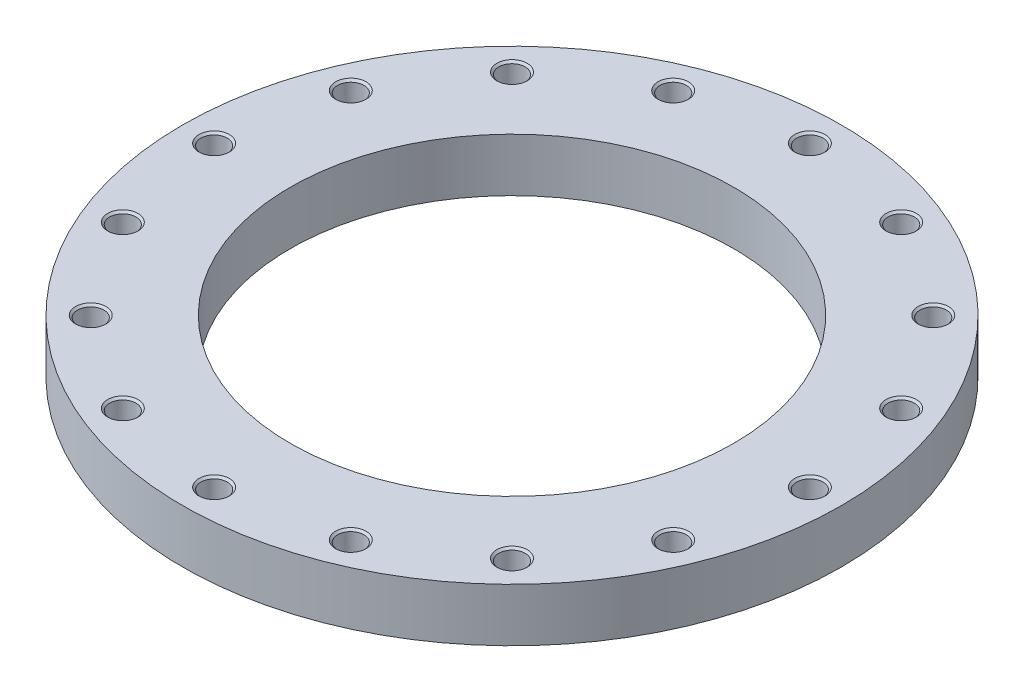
ISO-10303-21;
HEADER;
FILE_DESCRIPTION(('STEP AP214'),'2;1');
FILE_NAME('part.step','',(''),(''),'','','');
FILE_SCHEMA(('AUTOMOTIVE_DESIGN { 1 0 10303 214 1 1 1 1 }'));
ENDSEC;
DATA;
#1=APPLICATION_CONTEXT('core data for automotive mechanical design processes');
#2=APPLICATION_PROTOCOL_DEFINITION('international standard','automotive_design',2000,#1);
#3=PRODUCT_CONTEXT('',#1,'mechanical');
#4=PRODUCT('Part','Part','',(#3));
#5=PRODUCT_RELATED_PRODUCT_CATEGORY('part','',(#4));
#6=PRODUCT_DEFINITION_FORMATION('','',#4);
#7=PRODUCT_DEFINITION_CONTEXT('part definition',#1,'design');
#8=PRODUCT_DEFINITION('design','',#6,#7);
#9=PRODUCT_DEFINITION_SHAPE('','',#8);
#10=(LENGTH_UNIT() NAMED_UNIT(*) SI_UNIT(.MILLI.,.METRE.));
#11=(NAMED_UNIT(*) PLANE_ANGLE_UNIT() SI_UNIT($,.RADIAN.));
#12=(NAMED_UNIT(*) SI_UNIT($,.STERADIAN.) SOLID_ANGLE_UNIT());
#13=UNCERTAINTY_MEASURE_WITH_UNIT(LENGTH_MEASURE(1.E-05),#10,'distance_accuracy_value','');
#14=(GEOMETRIC_REPRESENTATION_CONTEXT(3) GLOBAL_UNCERTAINTY_ASSIGNED_CONTEXT((#13)) GLOBAL_UNIT_ASSIGNED_CONTEXT((#10,
#11,#12)) REPRESENTATION_CONTEXT('',''));
#15=CARTESIAN_POINT('',(0.,0.,0.));
#16=DIRECTION('',(0.,0.,1.));
#17=DIRECTION('',(1.,0.,0.));
#18=AXIS2_PLACEMENT_3D('',#15,#16,#17);
#19=CARTESIAN_POINT('',(0.,21.,0.));
#20=DIRECTION('',(0.,-1.,0.));
#21=DIRECTION('',(1.,0.,0.));
#22=AXIS2_PLACEMENT_3D('',#19,#20,#21);
#23=CYLINDRICAL_SURFACE('',#22,260.);
#24=CARTESIAN_POINT('',(0.,0.,0.));
#25=DIRECTION('',(0.,1.,0.));
#26=DIRECTION('',(1.,0.,0.));
#27=AXIS2_PLACEMENT_3D('',#24,#25,#26);
#28=CIRCLE('',#27,260.);
#29=CARTESIAN_POINT('',(260.,0.,0.));
#30=VERTEX_POINT('',#29);
#31=EDGE_CURVE('E9',#30,#30,#28,.T.);
#32=ORIENTED_EDGE('',*,*,#31,.T.);
#33=EDGE_LOOP('',(#32));
#34=FACE_BOUND('',#33,.T.);
#35=CARTESIAN_POINT('',(0.,42.,0.));
#36=DIRECTION('',(0.,1.,0.));
#37=DIRECTION('',(1.,0.,0.));
#38=AXIS2_PLACEMENT_3D('',#35,#36,#37);
#39=CIRCLE('',#38,260.);
#40=CARTESIAN_POINT('',(260.,42.,0.));
#41=VERTEX_POINT('',#40);
#42=EDGE_CURVE('E18',#41,#41,#39,.T.);
#43=ORIENTED_EDGE('',*,*,#42,.F.);
#44=EDGE_LOOP('',(#43));
#45=FACE_BOUND('',#44,.T.);
#46=ADVANCED_FACE('F15',(#34,#45),#23,.T.);
#47=CARTESIAN_POINT('',(217.5,0.,0.));
#48=DIRECTION('',(0.,-1.,0.));
#49=DIRECTION('',(-1.,0.,0.));
#50=AXIS2_PLACEMENT_3D('',#47,#48,#49);
#51=PLANE('',#50);
#52=CARTESIAN_POINT('',(0.,0.,0.));
#53=DIRECTION('',(0.,1.,0.));
#54=DIRECTION('',(1.,0.,0.));
#55=AXIS2_PLACEMENT_3D('',#52,#53,#54);
#56=CIRCLE('',#55,175.);
#57=CARTESIAN_POINT('',(175.,0.,0.));
#58=VERTEX_POINT('',#57);
#59=EDGE_CURVE('E24',#58,#58,#56,.T.);
#60=ORIENTED_EDGE('',*,*,#59,.T.);
#61=EDGE_LOOP('',(#60));
#62=FACE_BOUND('',#61,.T.);
#63=ORIENTED_EDGE('',*,*,#31,.F.);
#64=EDGE_LOOP('',(#63));
#65=FACE_BOUND('',#64,.T.);
#66=ADVANCED_FACE('F474',(#62,#65),#51,.T.);
#67=CARTESIAN_POINT('',(0.,21.,0.));
#68=DIRECTION('',(0.,-1.,0.));
#69=DIRECTION('',(1.,0.,0.));
#70=AXIS2_PLACEMENT_3D('',#67,#68,#69);
#71=CYLINDRICAL_SURFACE('',#70,175.);
#72=CARTESIAN_POINT('',(0.,42.,0.));
#73=DIRECTION('',(0.,1.,0.));
#74=DIRECTION('',(1.,0.,0.));
#75=AXIS2_PLACEMENT_3D('',#72,#73,#74);
#76=CIRCLE('',#75,175.);
#77=CARTESIAN_POINT('',(175.,42.,0.));
#78=VERTEX_POINT('',#77);
#79=EDGE_CURVE('E314',#78,#78,#76,.T.);
#80=ORIENTED_EDGE('',*,*,#79,.T.);
#81=EDGE_LOOP('',(#80));
#82=FACE_BOUND('',#81,.T.);
#83=ORIENTED_EDGE('',*,*,#59,.F.);
#84=EDGE_LOOP('',(#83));
#85=FACE_BOUND('',#84,.T.);
#86=ADVANCED_FACE('F478',(#82,#85),#71,.F.);
#87=CARTESIAN_POINT('',(217.5,42.,0.));
#88=DIRECTION('',(0.,1.,0.));
#89=DIRECTION('',(1.,0.,0.));
#90=AXIS2_PLACEMENT_3D('',#87,#88,#89);
#91=PLANE('',#90);
#92=ORIENTED_EDGE('',*,*,#42,.T.);
#93=EDGE_LOOP('',(#92));
#94=FACE_BOUND('',#93,.T.);
#95=ORIENTED_EDGE('',*,*,#79,.F.);
#96=EDGE_LOOP('',(#95));
#97=FACE_BOUND('',#96,.T.);
#98=CARTESIAN_POINT('',(235.,42.,0.));
#99=DIRECTION('',(0.,-1.,0.));
#100=DIRECTION('',(1.,0.,0.));
#101=AXIS2_PLACEMENT_3D('',#98,#99,#100);
#102=CIRCLE('',#101,12.);
#103=CARTESIAN_POINT('',(247.,42.,0.));
#104=VERTEX_POINT('',#103);
#105=EDGE_CURVE('E381',#104,#104,#102,.T.);
#106=ORIENTED_EDGE('',*,*,#105,.T.);
#107=EDGE_LOOP('',(#106));
#108=FACE_BOUND('',#107,.T.);
#109=CARTESIAN_POINT('',(217.111690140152,42.,-89.9306066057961));
#110=DIRECTION('',(0.,-1.,0.));
#111=DIRECTION('',(0.923879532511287,0.,-0.38268343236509));
#112=AXIS2_PLACEMENT_3D('',#109,#110,#111);
#113=CIRCLE('',#112,12.);
#114=CARTESIAN_POINT('',(228.198244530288,42.,-94.5228077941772));
#115=VERTEX_POINT('',#114);
#116=EDGE_CURVE('E411',#115,#115,#113,.T.);
#117=ORIENTED_EDGE('',*,*,#116,.T.);
#118=EDGE_LOOP('',(#117));
#119=FACE_BOUND('',#118,.T.);
#120=CARTESIAN_POINT('',(166.170093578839,42.,-166.170093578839));
#121=DIRECTION('',(0.,-1.,0.));
#122=DIRECTION('',(0.707106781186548,0.,-0.707106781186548));
#123=AXIS2_PLACEMENT_3D('',#120,#121,#122);
#124=CIRCLE('',#123,12.);
#125=CARTESIAN_POINT('',(174.655374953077,42.,-174.655374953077));
#126=VERTEX_POINT('',#125);
#127=EDGE_CURVE('E365',#126,#126,#124,.T.);
#128=ORIENTED_EDGE('',*,*,#127,.T.);
#129=EDGE_LOOP('',(#128));
#130=FACE_BOUND('',#129,.T.);
#131=CARTESIAN_POINT('',(89.9306066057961,42.,-217.111690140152));
#132=DIRECTION('',(0.,-1.,0.));
#133=DIRECTION('',(0.38268343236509,0.,-0.923879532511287));
#134=AXIS2_PLACEMENT_3D('',#131,#132,#133);
#135=CIRCLE('',#134,12.);
#136=CARTESIAN_POINT('',(94.5228077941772,42.,-228.198244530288));
#137=VERTEX_POINT('',#136);
#138=EDGE_CURVE('E352',#137,#137,#135,.T.);
#139=ORIENTED_EDGE('',*,*,#138,.T.);
#140=EDGE_LOOP('',(#139));
#141=FACE_BOUND('',#140,.T.);
#142=CARTESIAN_POINT('',(0.,42.,-235.));
#143=DIRECTION('',(0.,-1.,0.));
#144=DIRECTION('',(0.,0.,-1.));
#145=AXIS2_PLACEMENT_3D('',#142,#143,#144);
#146=CIRCLE('',#145,12.);
#147=CARTESIAN_POINT('',(0.,42.,-247.));
#148=VERTEX_POINT('',#147);
#149=EDGE_CURVE('E332',#148,#148,#146,.T.);
#150=ORIENTED_EDGE('',*,*,#149,.T.);
#151=EDGE_LOOP('',(#150));
#152=FACE_BOUND('',#151,.T.);
#153=CARTESIAN_POINT('',(-89.9306066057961,42.,-217.111690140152));
#154=DIRECTION('',(0.,-1.,0.));
#155=DIRECTION('',(-0.38268343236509,0.,-0.923879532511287));
#156=AXIS2_PLACEMENT_3D('',#153,#154,#155);
#157=CIRCLE('',#156,12.);
#158=CARTESIAN_POINT('',(-94.5228077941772,42.,-228.198244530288));
#159=VERTEX_POINT('',#158);
#160=EDGE_CURVE('E323',#159,#159,#157,.T.);
#161=ORIENTED_EDGE('',*,*,#160,.T.);
#162=EDGE_LOOP('',(#161));
#163=FACE_BOUND('',#162,.T.);
#164=CARTESIAN_POINT('',(-166.170093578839,42.,-166.170093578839));
#165=DIRECTION('',(0.,-1.,0.));
#166=DIRECTION('',(-0.707106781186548,0.,-0.707106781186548));
#167=AXIS2_PLACEMENT_3D('',#164,#165,#166);
#168=CIRCLE('',#167,12.);
#169=CARTESIAN_POINT('',(-174.655374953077,42.,-174.655374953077));
#170=VERTEX_POINT('',#169);
#171=EDGE_CURVE('E429',#170,#170,#168,.T.);
#172=ORIENTED_EDGE('',*,*,#171,.T.);
#173=EDGE_LOOP('',(#172));
#174=FACE_BOUND('',#173,.T.);
#175=CARTESIAN_POINT('',(-217.111690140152,42.,-89.9306066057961));
#176=DIRECTION('',(0.,-1.,0.));
#177=DIRECTION('',(-0.923879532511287,0.,-0.38268343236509));
#178=AXIS2_PLACEMENT_3D('',#175,#176,#177);
#179=CIRCLE('',#178,12.);
#180=CARTESIAN_POINT('',(-228.198244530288,42.,-94.5228077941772));
#181=VERTEX_POINT('',#180);
#182=EDGE_CURVE('E434',#181,#181,#179,.T.);
#183=ORIENTED_EDGE('',*,*,#182,.T.);
#184=EDGE_LOOP('',(#183));
#185=FACE_BOUND('',#184,.T.);
#186=CARTESIAN_POINT('',(-235.,42.,0.));
#187=DIRECTION('',(0.,-1.,0.));
#188=DIRECTION('',(-1.,0.,0.));
#189=AXIS2_PLACEMENT_3D('',#186,#187,#188);
#190=CIRCLE('',#189,12.);
#191=CARTESIAN_POINT('',(-247.,42.,0.));
#192=VERTEX_POINT('',#191);
#193=EDGE_CURVE('E414',#192,#192,#190,.T.);
#194=ORIENTED_EDGE('',*,*,#193,.T.);
#195=EDGE_LOOP('',(#194));
#196=FACE_BOUND('',#195,.T.);
#197=CARTESIAN_POINT('',(-217.111690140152,42.,89.9306066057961));
#198=DIRECTION('',(0.,-1.,0.));
#199=DIRECTION('',(-0.923879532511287,0.,0.38268343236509));
#200=AXIS2_PLACEMENT_3D('',#197,#198,#199);
#201=CIRCLE('',#200,12.);
#202=CARTESIAN_POINT('',(-228.198244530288,42.,94.5228077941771));
#203=VERTEX_POINT('',#202);
#204=EDGE_CURVE('E393',#203,#203,#201,.T.);
#205=ORIENTED_EDGE('',*,*,#204,.T.);
#206=EDGE_LOOP('',(#205));
#207=FACE_BOUND('',#206,.T.);
#208=CARTESIAN_POINT('',(-166.170093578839,42.,166.170093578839));
#209=DIRECTION('',(0.,-1.,0.));
#210=DIRECTION('',(-0.707106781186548,0.,0.707106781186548));
#211=AXIS2_PLACEMENT_3D('',#208,#209,#210);
#212=CIRCLE('',#211,12.);
#213=CARTESIAN_POINT('',(-174.655374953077,42.,174.655374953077));
#214=VERTEX_POINT('',#213);
#215=EDGE_CURVE('E866',#214,#214,#212,.T.);
#216=ORIENTED_EDGE('',*,*,#215,.T.);
#217=EDGE_LOOP('',(#216));
#218=FACE_BOUND('',#217,.T.);
#219=CARTESIAN_POINT('',(-89.9306066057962,42.,217.111690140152));
#220=DIRECTION('',(0.,-1.,0.));
#221=DIRECTION('',(-0.382683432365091,0.,0.923879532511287));
#222=AXIS2_PLACEMENT_3D('',#219,#220,#221);
#223=CIRCLE('',#222,12.);
#224=CARTESIAN_POINT('',(-94.5228077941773,42.,228.198244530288));
#225=VERTEX_POINT('',#224);
#226=EDGE_CURVE('E851',#225,#225,#223,.T.);
#227=ORIENTED_EDGE('',*,*,#226,.T.);
#228=EDGE_LOOP('',(#227));
#229=FACE_BOUND('',#228,.T.);
#230=CARTESIAN_POINT('',(0.,42.,235.));
#231=DIRECTION('',(0.,-1.,0.));
#232=DIRECTION('',(0.,0.,1.));
#233=AXIS2_PLACEMENT_3D('',#230,#231,#232);
#234=CIRCLE('',#233,12.);
#235=CARTESIAN_POINT('',(0.,42.,247.));
#236=VERTEX_POINT('',#235);
#237=EDGE_CURVE('E842',#236,#236,#234,.T.);
#238=ORIENTED_EDGE('',*,*,#237,.T.);
#239=EDGE_LOOP('',(#238));
#240=FACE_BOUND('',#239,.T.);
#241=CARTESIAN_POINT('',(89.9306066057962,42.,217.111690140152));
#242=DIRECTION('',(0.,-1.,0.));
#243=DIRECTION('',(0.38268343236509,0.,0.923879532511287));
#244=AXIS2_PLACEMENT_3D('',#241,#242,#243);
#245=CIRCLE('',#244,12.);
#246=CARTESIAN_POINT('',(94.5228077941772,42.,228.198244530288));
#247=VERTEX_POINT('',#246);
#248=EDGE_CURVE('E805',#247,#247,#245,.T.);
#249=ORIENTED_EDGE('',*,*,#248,.T.);
#250=EDGE_LOOP('',(#249));
#251=FACE_BOUND('',#250,.T.);
#252=CARTESIAN_POINT('',(166.170093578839,42.,166.170093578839));
#253=DIRECTION('',(0.,-1.,0.));
#254=DIRECTION('',(0.707106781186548,0.,0.707106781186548));
#255=AXIS2_PLACEMENT_3D('',#252,#253,#254);
#256=CIRCLE('',#255,12.);
#257=CARTESIAN_POINT('',(174.655374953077,42.,174.655374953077));
#258=VERTEX_POINT('',#257);
#259=EDGE_CURVE('E814',#258,#258,#256,.T.);
#260=ORIENTED_EDGE('',*,*,#259,.T.);
#261=EDGE_LOOP('',(#260));
#262=FACE_BOUND('',#261,.T.);
#263=CARTESIAN_POINT('',(217.111690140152,42.,89.9306066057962));
#264=DIRECTION('',(0.,-1.,0.));
#265=DIRECTION('',(0.923879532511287,0.,0.382683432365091));
#266=AXIS2_PLACEMENT_3D('',#263,#264,#265);
#267=CIRCLE('',#266,12.);
#268=CARTESIAN_POINT('',(228.198244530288,42.,94.5228077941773));
#269=VERTEX_POINT('',#268);
#270=EDGE_CURVE('E811',#269,#269,#267,.T.);
#271=ORIENTED_EDGE('',*,*,#270,.T.);
#272=EDGE_LOOP('',(#271));
#273=FACE_BOUND('',#272,.T.);
#274=ADVANCED_FACE('F311',(#94,#97,#108,#119,#130,#141,#152,#163,#174,#185,#196,#207,#218,#229,
#240,#251,#262,#273),#91,.T.);
#275=CARTESIAN_POINT('',(235.,6.00463463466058,0.));
#276=DIRECTION('',(0.,1.,0.));
#277=DIRECTION('',(1.,0.,0.));
#278=AXIS2_PLACEMENT_3D('',#275,#276,#277);
#279=CONICAL_SURFACE('',#278,5.188125,1.0471975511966);
#280=CARTESIAN_POINT('',(235.,9.,0.));
#281=DIRECTION('',(0.,-1.,0.));
#282=DIRECTION('',(1.,0.,0.));
#283=AXIS2_PLACEMENT_3D('',#280,#281,#282);
#284=CIRCLE('',#283,10.37625);
#285=CARTESIAN_POINT('',(245.37625,9.,0.));
#286=VERTEX_POINT('',#285);
#287=EDGE_CURVE('E316',#286,#286,#284,.T.);
#288=ORIENTED_EDGE('',*,*,#287,.F.);
#289=EDGE_LOOP('',(#288));
#290=FACE_BOUND('',#289,.T.);
#291=CARTESIAN_POINT('',(235.,3.00926926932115,0.));
#292=VERTEX_POINT('',#291);
#293=VERTEX_LOOP('',#292);
#294=FACE_BOUND('',#293,.T.);
#295=ADVANCED_FACE('F617',(#290,#294),#279,.F.);
#296=CARTESIAN_POINT('',(235.,12.688125,0.));
#297=DIRECTION('',(0.,1.,0.));
#298=DIRECTION('',(1.,0.,0.));
#299=AXIS2_PLACEMENT_3D('',#296,#297,#298);
#300=CYLINDRICAL_SURFACE('',#299,10.37625);
#301=CARTESIAN_POINT('',(235.,16.37625,0.));
#302=DIRECTION('',(0.,-1.,0.));
#303=DIRECTION('',(1.,0.,0.));
#304=AXIS2_PLACEMENT_3D('',#301,#302,#303);
#305=CIRCLE('',#304,10.37625);
#306=CARTESIAN_POINT('',(245.37625,16.37625,0.));
#307=VERTEX_POINT('',#306);
#308=EDGE_CURVE('E320',#307,#307,#305,.T.);
#309=ORIENTED_EDGE('',*,*,#308,.F.);
#310=EDGE_LOOP('',(#309));
#311=FACE_BOUND('',#310,.T.);
#312=ORIENTED_EDGE('',*,*,#287,.T.);
#313=EDGE_LOOP('',(#312));
#314=FACE_BOUND('',#313,.T.);
#315=ADVANCED_FACE('F961',(#311,#314),#300,.F.);
#316=CARTESIAN_POINT('',(235.,17.188125,0.));
#317=DIRECTION('',(0.,1.,0.));
#318=DIRECTION('',(1.,0.,0.));
#319=AXIS2_PLACEMENT_3D('',#316,#317,#318);
#320=CONICAL_SURFACE('',#319,11.188125,0.785398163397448);
#321=CARTESIAN_POINT('',(235.,18.,0.));
#322=DIRECTION('',(0.,-1.,0.));
#323=DIRECTION('',(1.,0.,0.));
#324=AXIS2_PLACEMENT_3D('',#321,#322,#323);
#325=CIRCLE('',#324,12.);
#326=CARTESIAN_POINT('',(247.,18.,0.));
#327=VERTEX_POINT('',#326);
#328=EDGE_CURVE('E356',#327,#327,#325,.T.);
#329=ORIENTED_EDGE('',*,*,#328,.F.);
#330=EDGE_LOOP('',(#329));
#331=FACE_BOUND('',#330,.T.);
#332=ORIENTED_EDGE('',*,*,#308,.T.);
#333=EDGE_LOOP('',(#332));
#334=FACE_BOUND('',#333,.T.);
#335=ADVANCED_FACE('F957',(#331,#334),#320,.F.);
#336=CARTESIAN_POINT('',(246.188125,18.,0.));
#337=DIRECTION('',(0.,1.,0.));
#338=DIRECTION('',(-1.,0.,0.));
#339=AXIS2_PLACEMENT_3D('',#336,#337,#338);
#340=PLANE('',#339);
#341=CARTESIAN_POINT('',(235.,18.,0.));
#342=DIRECTION('',(0.,-1.,0.));
#343=DIRECTION('',(1.,0.,0.));
#344=AXIS2_PLACEMENT_3D('',#341,#342,#343);
#345=CIRCLE('',#344,10.37625);
#346=CARTESIAN_POINT('',(245.37625,18.,0.));
#347=VERTEX_POINT('',#346);
#348=EDGE_CURVE('E378',#347,#347,#345,.T.);
#349=ORIENTED_EDGE('',*,*,#348,.F.);
#350=EDGE_LOOP('',(#349));
#351=FACE_BOUND('',#350,.T.);
#352=ORIENTED_EDGE('',*,*,#328,.T.);
#353=EDGE_LOOP('',(#352));
#354=FACE_BOUND('',#353,.T.);
#355=ADVANCED_FACE('F960',(#351,#354),#340,.F.);
#356=CARTESIAN_POINT('',(235.,29.188125,0.));
#357=DIRECTION('',(0.,1.,0.));
#358=DIRECTION('',(1.,0.,0.));
#359=AXIS2_PLACEMENT_3D('',#356,#357,#358);
#360=CYLINDRICAL_SURFACE('',#359,10.37625);
#361=CARTESIAN_POINT('',(235.,40.37625,0.));
#362=DIRECTION('',(0.,-1.,0.));
#363=DIRECTION('',(1.,0.,0.));
#364=AXIS2_PLACEMENT_3D('',#361,#362,#363);
#365=CIRCLE('',#364,10.37625);
#366=CARTESIAN_POINT('',(245.37625,40.37625,0.));
#367=VERTEX_POINT('',#366);
#368=EDGE_CURVE('E377',#367,#367,#365,.T.);
#369=ORIENTED_EDGE('',*,*,#368,.F.);
#370=EDGE_LOOP('',(#369));
#371=FACE_BOUND('',#370,.T.);
#372=ORIENTED_EDGE('',*,*,#348,.T.);
#373=EDGE_LOOP('',(#372));
#374=FACE_BOUND('',#373,.T.);
#375=ADVANCED_FACE('F572',(#371,#374),#360,.F.);
#376=CARTESIAN_POINT('',(235.,41.188125,0.));
#377=DIRECTION('',(0.,1.,0.));
#378=DIRECTION('',(1.,0.,0.));
#379=AXIS2_PLACEMENT_3D('',#376,#377,#378);
#380=CONICAL_SURFACE('',#379,11.188125,0.785398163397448);
#381=ORIENTED_EDGE('',*,*,#105,.F.);
#382=EDGE_LOOP('',(#381));
#383=FACE_BOUND('',#382,.T.);
#384=ORIENTED_EDGE('',*,*,#368,.T.);
#385=EDGE_LOOP('',(#384));
#386=FACE_BOUND('',#385,.T.);
#387=ADVANCED_FACE('F568',(#383,#386),#380,.F.);
#388=CARTESIAN_POINT('',(217.111690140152,6.00463463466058,-89.9306066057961));
#389=DIRECTION('',(0.,1.,0.));
#390=DIRECTION('',(0.923879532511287,0.,-0.38268343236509));
#391=AXIS2_PLACEMENT_3D('',#388,#389,#390);
#392=CONICAL_SURFACE('',#391,5.188125,1.0471975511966);
#393=CARTESIAN_POINT('',(217.111690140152,9.,-89.9306066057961));
#394=DIRECTION('',(0.,-1.,0.));
#395=DIRECTION('',(0.923879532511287,0.,-0.38268343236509));
#396=AXIS2_PLACEMENT_3D('',#393,#394,#395);
#397=CIRCLE('',#396,10.37625);
#398=CARTESIAN_POINT('',(226.698095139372,9.,-93.9014255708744));
#399=VERTEX_POINT('',#398);
#400=EDGE_CURVE('E346',#399,#399,#397,.T.);
#401=ORIENTED_EDGE('',*,*,#400,.F.);
#402=EDGE_LOOP('',(#401));
#403=FACE_BOUND('',#402,.T.);
#404=CARTESIAN_POINT('',(217.111690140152,3.00926926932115,-89.9306066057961));
#405=VERTEX_POINT('',#404);
#406=VERTEX_LOOP('',#405);
#407=FACE_BOUND('',#406,.T.);
#408=ADVANCED_FACE('F571',(#403,#407),#392,.F.);
#409=CARTESIAN_POINT('',(217.111690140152,12.688125,-89.9306066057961));
#410=DIRECTION('',(0.,1.,0.));
#411=DIRECTION('',(0.923879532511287,0.,-0.38268343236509));
#412=AXIS2_PLACEMENT_3D('',#409,#410,#411);
#413=CYLINDRICAL_SURFACE('',#412,10.37625);
#414=CARTESIAN_POINT('',(217.111690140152,16.37625,-89.9306066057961));
#415=DIRECTION('',(0.,-1.,0.));
#416=DIRECTION('',(0.923879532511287,0.,-0.38268343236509));
#417=AXIS2_PLACEMENT_3D('',#414,#415,#416);
#418=CIRCLE('',#417,10.37625);
#419=CARTESIAN_POINT('',(226.698095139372,16.37625,-93.9014255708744));
#420=VERTEX_POINT('',#419);
#421=EDGE_CURVE('E344',#420,#420,#418,.T.);
#422=ORIENTED_EDGE('',*,*,#421,.F.);
#423=EDGE_LOOP('',(#422));
#424=FACE_BOUND('',#423,.T.);
#425=ORIENTED_EDGE('',*,*,#400,.T.);
#426=EDGE_LOOP('',(#425));
#427=FACE_BOUND('',#426,.T.);
#428=ADVANCED_FACE('F942',(#424,#427),#413,.F.);
#429=CARTESIAN_POINT('',(217.111690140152,17.188125,-89.9306066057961));
#430=DIRECTION('',(0.,1.,0.));
#431=DIRECTION('',(0.923879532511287,0.,-0.38268343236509));
#432=AXIS2_PLACEMENT_3D('',#429,#430,#431);
#433=CONICAL_SURFACE('',#432,11.188125,0.785398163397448);
#434=CARTESIAN_POINT('',(217.111690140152,18.,-89.9306066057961));
#435=DIRECTION('',(0.,-1.,0.));
#436=DIRECTION('',(0.923879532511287,0.,-0.38268343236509));
#437=AXIS2_PLACEMENT_3D('',#434,#435,#436);
#438=CIRCLE('',#437,12.);
#439=CARTESIAN_POINT('',(228.198244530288,18.,-94.5228077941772));
#440=VERTEX_POINT('',#439);
#441=EDGE_CURVE('E347',#440,#440,#438,.T.);
#442=ORIENTED_EDGE('',*,*,#441,.F.);
#443=EDGE_LOOP('',(#442));
#444=FACE_BOUND('',#443,.T.);
#445=ORIENTED_EDGE('',*,*,#421,.T.);
#446=EDGE_LOOP('',(#445));
#447=FACE_BOUND('',#446,.T.);
#448=ADVANCED_FACE('F981',(#444,#447),#433,.F.);
#449=CARTESIAN_POINT('',(227.448169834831,18.,-94.2121166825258));
#450=DIRECTION('',(0.,1.,0.));
#451=DIRECTION('',(-0.923879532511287,0.,0.38268343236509));
#452=AXIS2_PLACEMENT_3D('',#449,#450,#451);
#453=PLANE('',#452);
#454=CARTESIAN_POINT('',(217.111690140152,18.,-89.9306066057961));
#455=DIRECTION('',(0.,-1.,0.));
#456=DIRECTION('',(0.923879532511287,0.,-0.38268343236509));
#457=AXIS2_PLACEMENT_3D('',#454,#455,#456);
#458=CIRCLE('',#457,10.37625);
#459=CARTESIAN_POINT('',(226.698095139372,18.,-93.9014255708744));
#460=VERTEX_POINT('',#459);
#461=EDGE_CURVE('E375',#460,#460,#458,.T.);
#462=ORIENTED_EDGE('',*,*,#461,.F.);
#463=EDGE_LOOP('',(#462));
#464=FACE_BOUND('',#463,.T.);
#465=ORIENTED_EDGE('',*,*,#441,.T.);
#466=EDGE_LOOP('',(#465));
#467=FACE_BOUND('',#466,.T.);
#468=ADVANCED_FACE('F977',(#464,#467),#453,.F.);
#469=CARTESIAN_POINT('',(217.111690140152,29.188125,-89.9306066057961));
#470=DIRECTION('',(0.,1.,0.));
#471=DIRECTION('',(0.923879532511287,0.,-0.38268343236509));
#472=AXIS2_PLACEMENT_3D('',#469,#470,#471);
#473=CYLINDRICAL_SURFACE('',#472,10.37625);
#474=CARTESIAN_POINT('',(217.111690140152,40.37625,-89.9306066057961));
#475=DIRECTION('',(0.,-1.,0.));
#476=DIRECTION('',(0.923879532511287,0.,-0.38268343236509));
#477=AXIS2_PLACEMENT_3D('',#474,#475,#476);
#478=CIRCLE('',#477,10.37625);
#479=CARTESIAN_POINT('',(226.698095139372,40.37625,-93.9014255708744));
#480=VERTEX_POINT('',#479);
#481=EDGE_CURVE('E336',#480,#480,#478,.T.);
#482=ORIENTED_EDGE('',*,*,#481,.F.);
#483=EDGE_LOOP('',(#482));
#484=FACE_BOUND('',#483,.T.);
#485=ORIENTED_EDGE('',*,*,#461,.T.);
#486=EDGE_LOOP('',(#485));
#487=FACE_BOUND('',#486,.T.);
#488=ADVANCED_FACE('F924',(#484,#487),#473,.F.);
#489=CARTESIAN_POINT('',(217.111690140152,41.188125,-89.9306066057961));
#490=DIRECTION('',(0.,1.,0.));
#491=DIRECTION('',(0.923879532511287,0.,-0.38268343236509));
#492=AXIS2_PLACEMENT_3D('',#489,#490,#491);
#493=CONICAL_SURFACE('',#492,11.188125,0.785398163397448);
#494=ORIENTED_EDGE('',*,*,#116,.F.);
#495=EDGE_LOOP('',(#494));
#496=FACE_BOUND('',#495,.T.);
#497=ORIENTED_EDGE('',*,*,#481,.T.);
#498=EDGE_LOOP('',(#497));
#499=FACE_BOUND('',#498,.T.);
#500=ADVANCED_FACE('F913',(#496,#499),#493,.F.);
#501=CARTESIAN_POINT('',(166.170093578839,6.00463463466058,-166.170093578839));
#502=DIRECTION('',(0.,1.,0.));
#503=DIRECTION('',(0.707106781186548,0.,-0.707106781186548));
#504=AXIS2_PLACEMENT_3D('',#501,#502,#503);
#505=CONICAL_SURFACE('',#504,5.188125,1.0471975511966);
#506=CARTESIAN_POINT('',(166.170093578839,9.,-166.170093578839));
#507=DIRECTION('',(0.,-1.,0.));
#508=DIRECTION('',(0.707106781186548,0.,-0.707106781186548));
#509=AXIS2_PLACEMENT_3D('',#506,#507,#508);
#510=CIRCLE('',#509,10.37625);
#511=CARTESIAN_POINT('',(173.507210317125,9.,-173.507210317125));
#512=VERTEX_POINT('',#511);
#513=EDGE_CURVE('E334',#512,#512,#510,.T.);
#514=ORIENTED_EDGE('',*,*,#513,.F.);
#515=EDGE_LOOP('',(#514));
#516=FACE_BOUND('',#515,.T.);
#517=CARTESIAN_POINT('',(166.170093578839,3.00926926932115,-166.170093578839));
#518=VERTEX_POINT('',#517);
#519=VERTEX_LOOP('',#518);
#520=FACE_BOUND('',#519,.T.);
#521=ADVANCED_FACE('F905',(#516,#520),#505,.F.);
#522=CARTESIAN_POINT('',(166.170093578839,12.688125,-166.170093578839));
#523=DIRECTION('',(0.,1.,0.));
#524=DIRECTION('',(0.707106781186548,0.,-0.707106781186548));
#525=AXIS2_PLACEMENT_3D('',#522,#523,#524);
#526=CYLINDRICAL_SURFACE('',#525,10.37625);
#527=CARTESIAN_POINT('',(166.170093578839,16.37625,-166.170093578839));
#528=DIRECTION('',(0.,-1.,0.));
#529=DIRECTION('',(0.707106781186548,0.,-0.707106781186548));
#530=AXIS2_PLACEMENT_3D('',#527,#528,#529);
#531=CIRCLE('',#530,10.37625);
#532=CARTESIAN_POINT('',(173.507210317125,16.37625,-173.507210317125));
#533=VERTEX_POINT('',#532);
#534=EDGE_CURVE('E337',#533,#533,#531,.T.);
#535=ORIENTED_EDGE('',*,*,#534,.F.);
#536=EDGE_LOOP('',(#535));
#537=FACE_BOUND('',#536,.T.);
#538=ORIENTED_EDGE('',*,*,#513,.T.);
#539=EDGE_LOOP('',(#538));
#540=FACE_BOUND('',#539,.T.);
#541=ADVANCED_FACE('F902',(#537,#540),#526,.F.);
#542=CARTESIAN_POINT('',(166.170093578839,17.188125,-166.170093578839));
#543=DIRECTION('',(0.,1.,0.));
#544=DIRECTION('',(0.707106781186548,0.,-0.707106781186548));
#545=AXIS2_PLACEMENT_3D('',#542,#543,#544);
#546=CONICAL_SURFACE('',#545,11.188125,0.785398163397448);
#547=CARTESIAN_POINT('',(166.170093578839,18.,-166.170093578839));
#548=DIRECTION('',(0.,-1.,0.));
#549=DIRECTION('',(0.707106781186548,0.,-0.707106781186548));
#550=AXIS2_PLACEMENT_3D('',#547,#548,#549);
#551=CIRCLE('',#550,12.);
#552=CARTESIAN_POINT('',(174.655374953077,18.,-174.655374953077));
#553=VERTEX_POINT('',#552);
#554=EDGE_CURVE('E370',#553,#553,#551,.T.);
#555=ORIENTED_EDGE('',*,*,#554,.F.);
#556=EDGE_LOOP('',(#555));
#557=FACE_BOUND('',#556,.T.);
#558=ORIENTED_EDGE('',*,*,#534,.T.);
#559=EDGE_LOOP('',(#558));
#560=FACE_BOUND('',#559,.T.);
#561=ADVANCED_FACE('F904',(#557,#560),#546,.F.);
#562=CARTESIAN_POINT('',(174.081292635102,18.,-174.081292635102));
#563=DIRECTION('',(0.,1.,0.));
#564=DIRECTION('',(-0.707106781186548,0.,0.707106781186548));
#565=AXIS2_PLACEMENT_3D('',#562,#563,#564);
#566=PLANE('',#565);
#567=CARTESIAN_POINT('',(166.170093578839,18.,-166.170093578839));
#568=DIRECTION('',(0.,-1.,0.));
#569=DIRECTION('',(0.707106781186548,0.,-0.707106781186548));
#570=AXIS2_PLACEMENT_3D('',#567,#568,#569);
#571=CIRCLE('',#570,10.37625);
#572=CARTESIAN_POINT('',(173.507210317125,18.,-173.507210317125));
#573=VERTEX_POINT('',#572);
#574=EDGE_CURVE('E367',#573,#573,#571,.T.);
#575=ORIENTED_EDGE('',*,*,#574,.F.);
#576=EDGE_LOOP('',(#575));
#577=FACE_BOUND('',#576,.T.);
#578=ORIENTED_EDGE('',*,*,#554,.T.);
#579=EDGE_LOOP('',(#578));
#580=FACE_BOUND('',#579,.T.);
#581=ADVANCED_FACE('F688',(#577,#580),#566,.F.);
#582=CARTESIAN_POINT('',(166.170093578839,29.188125,-166.170093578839));
#583=DIRECTION('',(0.,1.,0.));
#584=DIRECTION('',(0.707106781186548,0.,-0.707106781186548));
#585=AXIS2_PLACEMENT_3D('',#582,#583,#584);
#586=CYLINDRICAL_SURFACE('',#585,10.37625);
#587=CARTESIAN_POINT('',(166.170093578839,40.37625,-166.170093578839));
#588=DIRECTION('',(0.,-1.,0.));
#589=DIRECTION('',(0.707106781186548,0.,-0.707106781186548));
#590=AXIS2_PLACEMENT_3D('',#587,#588,#589);
#591=CIRCLE('',#590,10.37625);
#592=CARTESIAN_POINT('',(173.507210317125,40.37625,-173.507210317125));
#593=VERTEX_POINT('',#592);
#594=EDGE_CURVE('E363',#593,#593,#591,.T.);
#595=ORIENTED_EDGE('',*,*,#594,.F.);
#596=EDGE_LOOP('',(#595));
#597=FACE_BOUND('',#596,.T.);
#598=ORIENTED_EDGE('',*,*,#574,.T.);
#599=EDGE_LOOP('',(#598));
#600=FACE_BOUND('',#599,.T.);
#601=ADVANCED_FACE('F684',(#597,#600),#586,.F.);
#602=CARTESIAN_POINT('',(166.170093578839,41.188125,-166.170093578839));
#603=DIRECTION('',(0.,1.,0.));
#604=DIRECTION('',(0.707106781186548,0.,-0.707106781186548));
#605=AXIS2_PLACEMENT_3D('',#602,#603,#604);
#606=CONICAL_SURFACE('',#605,11.188125,0.785398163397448);
#607=ORIENTED_EDGE('',*,*,#127,.F.);
#608=EDGE_LOOP('',(#607));
#609=FACE_BOUND('',#608,.T.);
#610=ORIENTED_EDGE('',*,*,#594,.T.);
#611=EDGE_LOOP('',(#610));
#612=FACE_BOUND('',#611,.T.);
#613=ADVANCED_FACE('F687',(#609,#612),#606,.F.);
#614=CARTESIAN_POINT('',(89.9306066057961,6.00463463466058,-217.111690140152));
#615=DIRECTION('',(0.,1.,0.));
#616=DIRECTION('',(0.38268343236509,0.,-0.923879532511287));
#617=AXIS2_PLACEMENT_3D('',#614,#615,#616);
#618=CONICAL_SURFACE('',#617,5.188125,1.0471975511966);
#619=CARTESIAN_POINT('',(89.9306066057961,9.,-217.111690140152));
#620=DIRECTION('',(0.,-1.,0.));
#621=DIRECTION('',(0.38268343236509,0.,-0.923879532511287));
#622=AXIS2_PLACEMENT_3D('',#619,#620,#621);
#623=CIRCLE('',#622,10.37625);
#624=CARTESIAN_POINT('',(93.9014255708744,9.,-226.698095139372));
#625=VERTEX_POINT('',#624);
#626=EDGE_CURVE('E361',#625,#625,#623,.T.);
#627=ORIENTED_EDGE('',*,*,#626,.F.);
#628=EDGE_LOOP('',(#627));
#629=FACE_BOUND('',#628,.T.);
#630=CARTESIAN_POINT('',(89.9306066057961,3.00926926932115,-217.111690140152));
#631=VERTEX_POINT('',#630);
#632=VERTEX_LOOP('',#631);
#633=FACE_BOUND('',#632,.T.);
#634=ADVANCED_FACE('F701',(#629,#633),#618,.F.);
#635=CARTESIAN_POINT('',(89.9306066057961,12.688125,-217.111690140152));
#636=DIRECTION('',(0.,1.,0.));
#637=DIRECTION('',(0.38268343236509,0.,-0.923879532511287));
#638=AXIS2_PLACEMENT_3D('',#635,#636,#637);
#639=CYLINDRICAL_SURFACE('',#638,10.37625);
#640=CARTESIAN_POINT('',(89.9306066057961,16.37625,-217.111690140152));
#641=DIRECTION('',(0.,-1.,0.));
#642=DIRECTION('',(0.38268343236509,0.,-0.923879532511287));
#643=AXIS2_PLACEMENT_3D('',#640,#641,#642);
#644=CIRCLE('',#643,10.37625);
#645=CARTESIAN_POINT('',(93.9014255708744,16.37625,-226.698095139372));
#646=VERTEX_POINT('',#645);
#647=EDGE_CURVE('E359',#646,#646,#644,.T.);
#648=ORIENTED_EDGE('',*,*,#647,.F.);
#649=EDGE_LOOP('',(#648));
#650=FACE_BOUND('',#649,.T.);
#651=ORIENTED_EDGE('',*,*,#626,.T.);
#652=EDGE_LOOP('',(#651));
#653=FACE_BOUND('',#652,.T.);
#654=ADVANCED_FACE('F697',(#650,#653),#639,.F.);
#655=CARTESIAN_POINT('',(89.9306066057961,17.188125,-217.111690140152));
#656=DIRECTION('',(0.,1.,0.));
#657=DIRECTION('',(0.38268343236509,0.,-0.923879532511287));
#658=AXIS2_PLACEMENT_3D('',#655,#656,#657);
#659=CONICAL_SURFACE('',#658,11.188125,0.785398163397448);
#660=CARTESIAN_POINT('',(89.9306066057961,18.,-217.111690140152));
#661=DIRECTION('',(0.,-1.,0.));
#662=DIRECTION('',(0.38268343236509,0.,-0.923879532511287));
#663=AXIS2_PLACEMENT_3D('',#660,#661,#662);
#664=CIRCLE('',#663,12.);
#665=CARTESIAN_POINT('',(94.5228077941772,18.,-228.198244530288));
#666=VERTEX_POINT('',#665);
#667=EDGE_CURVE('E358',#666,#666,#664,.T.);
#668=ORIENTED_EDGE('',*,*,#667,.F.);
#669=EDGE_LOOP('',(#668));
#670=FACE_BOUND('',#669,.T.);
#671=ORIENTED_EDGE('',*,*,#647,.T.);
#672=EDGE_LOOP('',(#671));
#673=FACE_BOUND('',#672,.T.);
#674=ADVANCED_FACE('F700',(#670,#673),#659,.F.);
#675=CARTESIAN_POINT('',(94.2121166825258,18.,-227.448169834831));
#676=DIRECTION('',(0.,1.,0.));
#677=DIRECTION('',(-0.38268343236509,0.,0.923879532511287));
#678=AXIS2_PLACEMENT_3D('',#675,#676,#677);
#679=PLANE('',#678);
#680=CARTESIAN_POINT('',(89.9306066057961,18.,-217.111690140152));
#681=DIRECTION('',(0.,-1.,0.));
#682=DIRECTION('',(0.38268343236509,0.,-0.923879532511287));
#683=AXIS2_PLACEMENT_3D('',#680,#681,#682);
#684=CIRCLE('',#683,10.37625);
#685=CARTESIAN_POINT('',(93.9014255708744,18.,-226.698095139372));
#686=VERTEX_POINT('',#685);
#687=EDGE_CURVE('E354',#686,#686,#684,.T.);
#688=ORIENTED_EDGE('',*,*,#687,.F.);
#689=EDGE_LOOP('',(#688));
#690=FACE_BOUND('',#689,.T.);
#691=ORIENTED_EDGE('',*,*,#667,.T.);
#692=EDGE_LOOP('',(#691));
#693=FACE_BOUND('',#692,.T.);
#694=ADVANCED_FACE('F952',(#690,#693),#679,.F.);
#695=CARTESIAN_POINT('',(89.9306066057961,29.188125,-217.111690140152));
#696=DIRECTION('',(0.,1.,0.));
#697=DIRECTION('',(0.38268343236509,0.,-0.923879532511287));
#698=AXIS2_PLACEMENT_3D('',#695,#696,#697);
#699=CYLINDRICAL_SURFACE('',#698,10.37625);
#700=CARTESIAN_POINT('',(89.9306066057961,40.37625,-217.111690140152));
#701=DIRECTION('',(0.,-1.,0.));
#702=DIRECTION('',(0.38268343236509,0.,-0.923879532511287));
#703=AXIS2_PLACEMENT_3D('',#700,#701,#702);
#704=CIRCLE('',#703,10.37625);
#705=CARTESIAN_POINT('',(93.9014255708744,40.37625,-226.698095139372));
#706=VERTEX_POINT('',#705);
#707=EDGE_CURVE('E350',#706,#706,#704,.T.);
#708=ORIENTED_EDGE('',*,*,#707,.F.);
#709=EDGE_LOOP('',(#708));
#710=FACE_BOUND('',#709,.T.);
#711=ORIENTED_EDGE('',*,*,#687,.T.);
#712=EDGE_LOOP('',(#711));
#713=FACE_BOUND('',#712,.T.);
#714=ADVANCED_FACE('F674',(#710,#713),#699,.F.);
#715=CARTESIAN_POINT('',(89.9306066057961,41.188125,-217.111690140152));
#716=DIRECTION('',(0.,1.,0.));
#717=DIRECTION('',(0.38268343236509,0.,-0.923879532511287));
#718=AXIS2_PLACEMENT_3D('',#715,#716,#717);
#719=CONICAL_SURFACE('',#718,11.188125,0.785398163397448);
#720=ORIENTED_EDGE('',*,*,#138,.F.);
#721=EDGE_LOOP('',(#720));
#722=FACE_BOUND('',#721,.T.);
#723=ORIENTED_EDGE('',*,*,#707,.T.);
#724=EDGE_LOOP('',(#723));
#725=FACE_BOUND('',#724,.T.);
#726=ADVANCED_FACE('F671',(#722,#725),#719,.F.);
#727=CARTESIAN_POINT('',(0.,6.00463463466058,-235.));
#728=DIRECTION('',(0.,1.,0.));
#729=DIRECTION('',(0.,0.,-1.));
#730=AXIS2_PLACEMENT_3D('',#727,#728,#729);
#731=CONICAL_SURFACE('',#730,5.188125,1.0471975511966);
#732=CARTESIAN_POINT('',(0.,9.,-235.));
#733=DIRECTION('',(0.,-1.,0.));
#734=DIRECTION('',(0.,0.,-1.));
#735=AXIS2_PLACEMENT_3D('',#732,#733,#734);
#736=CIRCLE('',#735,10.37625);
#737=CARTESIAN_POINT('',(0.,9.,-245.37625));
#738=VERTEX_POINT('',#737);
#739=EDGE_CURVE('E349',#738,#738,#736,.T.);
#740=ORIENTED_EDGE('',*,*,#739,.F.);
#741=EDGE_LOOP('',(#740));
#742=FACE_BOUND('',#741,.T.);
#743=CARTESIAN_POINT('',(0.,3.00926926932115,-235.));
#744=VERTEX_POINT('',#743);
#745=VERTEX_LOOP('',#744);
#746=FACE_BOUND('',#745,.T.);
#747=ADVANCED_FACE('F586',(#742,#746),#731,.F.);
#748=CARTESIAN_POINT('',(0.,12.688125,-235.));
#749=DIRECTION('',(0.,1.,0.));
#750=DIRECTION('',(0.,0.,-1.));
#751=AXIS2_PLACEMENT_3D('',#748,#749,#750);
#752=CYLINDRICAL_SURFACE('',#751,10.37625);
#753=CARTESIAN_POINT('',(0.,16.37625,-235.));
#754=DIRECTION('',(0.,-1.,0.));
#755=DIRECTION('',(0.,0.,-1.));
#756=AXIS2_PLACEMENT_3D('',#753,#754,#755);
#757=CIRCLE('',#756,10.37625);
#758=CARTESIAN_POINT('',(0.,16.37625,-245.37625));
#759=VERTEX_POINT('',#758);
#760=EDGE_CURVE('E343',#759,#759,#757,.T.);
#761=ORIENTED_EDGE('',*,*,#760,.F.);
#762=EDGE_LOOP('',(#761));
#763=FACE_BOUND('',#762,.T.);
#764=ORIENTED_EDGE('',*,*,#739,.T.);
#765=EDGE_LOOP('',(#764));
#766=FACE_BOUND('',#765,.T.);
#767=ADVANCED_FACE('F582',(#763,#766),#752,.F.);
#768=CARTESIAN_POINT('',(0.,17.188125,-235.));
#769=DIRECTION('',(0.,1.,0.));
#770=DIRECTION('',(0.,0.,-1.));
#771=AXIS2_PLACEMENT_3D('',#768,#769,#770);
#772=CONICAL_SURFACE('',#771,11.188125,0.785398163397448);
#773=CARTESIAN_POINT('',(0.,18.,-235.));
#774=DIRECTION('',(0.,-1.,0.));
#775=DIRECTION('',(0.,0.,-1.));
#776=AXIS2_PLACEMENT_3D('',#773,#774,#775);
#777=CIRCLE('',#776,12.);
#778=CARTESIAN_POINT('',(0.,18.,-247.));
#779=VERTEX_POINT('',#778);
#780=EDGE_CURVE('E341',#779,#779,#777,.T.);
#781=ORIENTED_EDGE('',*,*,#780,.F.);
#782=EDGE_LOOP('',(#781));
#783=FACE_BOUND('',#782,.T.);
#784=ORIENTED_EDGE('',*,*,#760,.T.);
#785=EDGE_LOOP('',(#784));
#786=FACE_BOUND('',#785,.T.);
#787=ADVANCED_FACE('F585',(#783,#786),#772,.F.);
#788=CARTESIAN_POINT('',(0.,18.,-246.188125));
#789=DIRECTION('',(0.,1.,0.));
#790=DIRECTION('',(0.,0.,1.));
#791=AXIS2_PLACEMENT_3D('',#788,#789,#790);
#792=PLANE('',#791);
#793=CARTESIAN_POINT('',(0.,18.,-235.));
#794=DIRECTION('',(0.,-1.,0.));
#795=DIRECTION('',(0.,0.,-1.));
#796=AXIS2_PLACEMENT_3D('',#793,#794,#795);
#797=CIRCLE('',#796,10.37625);
#798=CARTESIAN_POINT('',(0.,18.,-245.37625));
#799=VERTEX_POINT('',#798);
#800=EDGE_CURVE('E339',#799,#799,#797,.T.);
#801=ORIENTED_EDGE('',*,*,#800,.F.);
#802=EDGE_LOOP('',(#801));
#803=FACE_BOUND('',#802,.T.);
#804=ORIENTED_EDGE('',*,*,#780,.T.);
#805=EDGE_LOOP('',(#804));
#806=FACE_BOUND('',#805,.T.);
#807=ADVANCED_FACE('F649',(#803,#806),#792,.F.);
#808=CARTESIAN_POINT('',(0.,29.188125,-235.));
#809=DIRECTION('',(0.,1.,0.));
#810=DIRECTION('',(0.,0.,-1.));
#811=AXIS2_PLACEMENT_3D('',#808,#809,#810);
#812=CYLINDRICAL_SURFACE('',#811,10.37625);
#813=CARTESIAN_POINT('',(0.,40.37625,-235.));
#814=DIRECTION('',(0.,-1.,0.));
#815=DIRECTION('',(0.,0.,-1.));
#816=AXIS2_PLACEMENT_3D('',#813,#814,#815);
#817=CIRCLE('',#816,10.37625);
#818=CARTESIAN_POINT('',(0.,40.37625,-245.37625));
#819=VERTEX_POINT('',#818);
#820=EDGE_CURVE('E330',#819,#819,#817,.T.);
#821=ORIENTED_EDGE('',*,*,#820,.F.);
#822=EDGE_LOOP('',(#821));
#823=FACE_BOUND('',#822,.T.);
#824=ORIENTED_EDGE('',*,*,#800,.T.);
#825=EDGE_LOOP('',(#824));
#826=FACE_BOUND('',#825,.T.);
#827=ADVANCED_FACE('F645',(#823,#826),#812,.F.);
#828=CARTESIAN_POINT('',(0.,41.188125,-235.));
#829=DIRECTION('',(0.,1.,0.));
#830=DIRECTION('',(0.,0.,-1.));
#831=AXIS2_PLACEMENT_3D('',#828,#829,#830);
#832=CONICAL_SURFACE('',#831,11.188125,0.785398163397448);
#833=ORIENTED_EDGE('',*,*,#149,.F.);
#834=EDGE_LOOP('',(#833));
#835=FACE_BOUND('',#834,.T.);
#836=ORIENTED_EDGE('',*,*,#820,.T.);
#837=EDGE_LOOP('',(#836));
#838=FACE_BOUND('',#837,.T.);
#839=ADVANCED_FACE('F648',(#835,#838),#832,.F.);
#840=CARTESIAN_POINT('',(-89.9306066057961,6.00463463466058,-217.111690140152));
#841=DIRECTION('',(0.,1.,0.));
#842=DIRECTION('',(-0.38268343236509,0.,-0.923879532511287));
#843=AXIS2_PLACEMENT_3D('',#840,#841,#842);
#844=CONICAL_SURFACE('',#843,5.188125,1.0471975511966);
#845=CARTESIAN_POINT('',(-89.9306066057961,9.,-217.111690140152));
#846=DIRECTION('',(0.,-1.,0.));
#847=DIRECTION('',(-0.38268343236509,0.,-0.923879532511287));
#848=AXIS2_PLACEMENT_3D('',#845,#846,#847);
#849=CIRCLE('',#848,10.37625);
#850=CARTESIAN_POINT('',(-93.9014255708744,9.,-226.698095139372));
#851=VERTEX_POINT('',#850);
#852=EDGE_CURVE('E333',#851,#851,#849,.T.);
#853=ORIENTED_EDGE('',*,*,#852,.F.);
#854=EDGE_LOOP('',(#853));
#855=FACE_BOUND('',#854,.T.);
#856=CARTESIAN_POINT('',(-89.9306066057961,3.00926926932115,-217.111690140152));
#857=VERTEX_POINT('',#856);
#858=VERTEX_LOOP('',#857);
#859=FACE_BOUND('',#858,.T.);
#860=ADVANCED_FACE('F930',(#855,#859),#844,.F.);
#861=CARTESIAN_POINT('',(-89.9306066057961,12.688125,-217.111690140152));
#862=DIRECTION('',(0.,1.,0.));
#863=DIRECTION('',(-0.38268343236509,0.,-0.923879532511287));
#864=AXIS2_PLACEMENT_3D('',#861,#862,#863);
#865=CYLINDRICAL_SURFACE('',#864,10.37625);
#866=CARTESIAN_POINT('',(-89.9306066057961,16.37625,-217.111690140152));
#867=DIRECTION('',(0.,-1.,0.));
#868=DIRECTION('',(-0.38268343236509,0.,-0.923879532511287));
#869=AXIS2_PLACEMENT_3D('',#866,#867,#868);
#870=CIRCLE('',#869,10.37625);
#871=CARTESIAN_POINT('',(-93.9014255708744,16.37625,-226.698095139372));
#872=VERTEX_POINT('',#871);
#873=EDGE_CURVE('E329',#872,#872,#870,.T.);
#874=ORIENTED_EDGE('',*,*,#873,.F.);
#875=EDGE_LOOP('',(#874));
#876=FACE_BOUND('',#875,.T.);
#877=ORIENTED_EDGE('',*,*,#852,.T.);
#878=EDGE_LOOP('',(#877));
#879=FACE_BOUND('',#878,.T.);
#880=ADVANCED_FACE('F929',(#876,#879),#865,.F.);
#881=CARTESIAN_POINT('',(-89.9306066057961,17.188125,-217.111690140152));
#882=DIRECTION('',(0.,1.,0.));
#883=DIRECTION('',(-0.38268343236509,0.,-0.923879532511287));
#884=AXIS2_PLACEMENT_3D('',#881,#882,#883);
#885=CONICAL_SURFACE('',#884,11.188125,0.785398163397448);
#886=CARTESIAN_POINT('',(-89.9306066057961,18.,-217.111690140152));
#887=DIRECTION('',(0.,-1.,0.));
#888=DIRECTION('',(-0.38268343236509,0.,-0.923879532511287));
#889=AXIS2_PLACEMENT_3D('',#886,#887,#888);
#890=CIRCLE('',#889,12.);
#891=CARTESIAN_POINT('',(-94.5228077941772,18.,-228.198244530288));
#892=VERTEX_POINT('',#891);
#893=EDGE_CURVE('E327',#892,#892,#890,.T.);
#894=ORIENTED_EDGE('',*,*,#893,.F.);
#895=EDGE_LOOP('',(#894));
#896=FACE_BOUND('',#895,.T.);
#897=ORIENTED_EDGE('',*,*,#873,.T.);
#898=EDGE_LOOP('',(#897));
#899=FACE_BOUND('',#898,.T.);
#900=ADVANCED_FACE('F558',(#896,#899),#885,.F.);
#901=CARTESIAN_POINT('',(-94.2121166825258,18.,-227.448169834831));
#902=DIRECTION('',(0.,1.,0.));
#903=DIRECTION('',(0.38268343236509,0.,0.923879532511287));
#904=AXIS2_PLACEMENT_3D('',#901,#902,#903);
#905=PLANE('',#904);
#906=CARTESIAN_POINT('',(-89.9306066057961,18.,-217.111690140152));
#907=DIRECTION('',(0.,-1.,0.));
#908=DIRECTION('',(-0.38268343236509,0.,-0.923879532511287));
#909=AXIS2_PLACEMENT_3D('',#906,#907,#908);
#910=CIRCLE('',#909,10.37625);
#911=CARTESIAN_POINT('',(-93.9014255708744,18.,-226.698095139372));
#912=VERTEX_POINT('',#911);
#913=EDGE_CURVE('E325',#912,#912,#910,.T.);
#914=ORIENTED_EDGE('',*,*,#913,.F.);
#915=EDGE_LOOP('',(#914));
#916=FACE_BOUND('',#915,.T.);
#917=ORIENTED_EDGE('',*,*,#893,.T.);
#918=EDGE_LOOP('',(#917));
#919=FACE_BOUND('',#918,.T.);
#920=ADVANCED_FACE('F469',(#916,#919),#905,.F.);
#921=CARTESIAN_POINT('',(-89.9306066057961,29.188125,-217.111690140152));
#922=DIRECTION('',(0.,1.,0.));
#923=DIRECTION('',(-0.38268343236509,0.,-0.923879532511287));
#924=AXIS2_PLACEMENT_3D('',#921,#922,#923);
#925=CYLINDRICAL_SURFACE('',#924,10.37625);
#926=CARTESIAN_POINT('',(-89.9306066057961,40.37625,-217.111690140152));
#927=DIRECTION('',(0.,-1.,0.));
#928=DIRECTION('',(-0.38268343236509,0.,-0.923879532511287));
#929=AXIS2_PLACEMENT_3D('',#926,#927,#928);
#930=CIRCLE('',#929,10.37625);
#931=CARTESIAN_POINT('',(-93.9014255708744,40.37625,-226.698095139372));
#932=VERTEX_POINT('',#931);
#933=EDGE_CURVE('E448',#932,#932,#930,.T.);
#934=ORIENTED_EDGE('',*,*,#933,.F.);
#935=EDGE_LOOP('',(#934));
#936=FACE_BOUND('',#935,.T.);
#937=ORIENTED_EDGE('',*,*,#913,.T.);
#938=EDGE_LOOP('',(#937));
#939=FACE_BOUND('',#938,.T.);
#940=ADVANCED_FACE('F459',(#936,#939),#925,.F.);
#941=CARTESIAN_POINT('',(-89.9306066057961,41.188125,-217.111690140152));
#942=DIRECTION('',(0.,1.,0.));
#943=DIRECTION('',(-0.38268343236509,0.,-0.923879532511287));
#944=AXIS2_PLACEMENT_3D('',#941,#942,#943);
#945=CONICAL_SURFACE('',#944,11.188125,0.785398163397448);
#946=ORIENTED_EDGE('',*,*,#160,.F.);
#947=EDGE_LOOP('',(#946));
#948=FACE_BOUND('',#947,.T.);
#949=ORIENTED_EDGE('',*,*,#933,.T.);
#950=EDGE_LOOP('',(#949));
#951=FACE_BOUND('',#950,.T.);
#952=ADVANCED_FACE('F456',(#948,#951),#945,.F.);
#953=CARTESIAN_POINT('',(-166.170093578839,6.00463463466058,-166.170093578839));
#954=DIRECTION('',(0.,1.,0.));
#955=DIRECTION('',(-0.707106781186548,0.,-0.707106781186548));
#956=AXIS2_PLACEMENT_3D('',#953,#954,#955);
#957=CONICAL_SURFACE('',#956,5.188125,1.0471975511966);
#958=CARTESIAN_POINT('',(-166.170093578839,9.,-166.170093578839));
#959=DIRECTION('',(0.,-1.,0.));
#960=DIRECTION('',(-0.707106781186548,0.,-0.707106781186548));
#961=AXIS2_PLACEMENT_3D('',#958,#959,#960);
#962=CIRCLE('',#961,10.37625);
#963=CARTESIAN_POINT('',(-173.507210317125,9.,-173.507210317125));
#964=VERTEX_POINT('',#963);
#965=EDGE_CURVE('E447',#964,#964,#962,.T.);
#966=ORIENTED_EDGE('',*,*,#965,.F.);
#967=EDGE_LOOP('',(#966));
#968=FACE_BOUND('',#967,.T.);
#969=CARTESIAN_POINT('',(-166.170093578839,3.00926926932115,-166.170093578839));
#970=VERTEX_POINT('',#969);
#971=VERTEX_LOOP('',#970);
#972=FACE_BOUND('',#971,.T.);
#973=ADVANCED_FACE('F458',(#968,#972),#957,.F.);
#974=CARTESIAN_POINT('',(-166.170093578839,12.688125,-166.170093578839));
#975=DIRECTION('',(0.,1.,0.));
#976=DIRECTION('',(-0.707106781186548,0.,-0.707106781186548));
#977=AXIS2_PLACEMENT_3D('',#974,#975,#976);
#978=CYLINDRICAL_SURFACE('',#977,10.37625);
#979=CARTESIAN_POINT('',(-166.170093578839,16.37625,-166.170093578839));
#980=DIRECTION('',(0.,-1.,0.));
#981=DIRECTION('',(-0.707106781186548,0.,-0.707106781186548));
#982=AXIS2_PLACEMENT_3D('',#979,#980,#981);
#983=CIRCLE('',#982,10.37625);
#984=CARTESIAN_POINT('',(-173.507210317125,16.37625,-173.507210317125));
#985=VERTEX_POINT('',#984);
#986=EDGE_CURVE('E444',#985,#985,#983,.T.);
#987=ORIENTED_EDGE('',*,*,#986,.F.);
#988=EDGE_LOOP('',(#987));
#989=FACE_BOUND('',#988,.T.);
#990=ORIENTED_EDGE('',*,*,#965,.T.);
#991=EDGE_LOOP('',(#990));
#992=FACE_BOUND('',#991,.T.);
#993=ADVANCED_FACE('F466',(#989,#992),#978,.F.);
#994=CARTESIAN_POINT('',(-166.170093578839,17.188125,-166.170093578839));
#995=DIRECTION('',(0.,1.,0.));
#996=DIRECTION('',(-0.707106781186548,0.,-0.707106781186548));
#997=AXIS2_PLACEMENT_3D('',#994,#995,#996);
#998=CONICAL_SURFACE('',#997,11.188125,0.785398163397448);
#999=CARTESIAN_POINT('',(-166.170093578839,18.,-166.170093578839));
#1000=DIRECTION('',(0.,-1.,0.));
#1001=DIRECTION('',(-0.707106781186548,0.,-0.707106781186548));
#1002=AXIS2_PLACEMENT_3D('',#999,#1000,#1001);
#1003=CIRCLE('',#1002,12.);
#1004=CARTESIAN_POINT('',(-174.655374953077,18.,-174.655374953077));
#1005=VERTEX_POINT('',#1004);
#1006=EDGE_CURVE('E428',#1005,#1005,#1003,.T.);
#1007=ORIENTED_EDGE('',*,*,#1006,.F.);
#1008=EDGE_LOOP('',(#1007));
#1009=FACE_BOUND('',#1008,.T.);
#1010=ORIENTED_EDGE('',*,*,#986,.T.);
#1011=EDGE_LOOP('',(#1010));
#1012=FACE_BOUND('',#1011,.T.);
#1013=ADVANCED_FACE('F521',(#1009,#1012),#998,.F.);
#1014=CARTESIAN_POINT('',(-174.081292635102,18.,-174.081292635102));
#1015=DIRECTION('',(0.,1.,0.));
#1016=DIRECTION('',(0.707106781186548,0.,0.707106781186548));
#1017=AXIS2_PLACEMENT_3D('',#1014,#1015,#1016);
#1018=PLANE('',#1017);
#1019=CARTESIAN_POINT('',(-166.170093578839,18.,-166.170093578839));
#1020=DIRECTION('',(0.,-1.,0.));
#1021=DIRECTION('',(-0.707106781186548,0.,-0.707106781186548));
#1022=AXIS2_PLACEMENT_3D('',#1019,#1020,#1021);
#1023=CIRCLE('',#1022,10.37625);
#1024=CARTESIAN_POINT('',(-173.507210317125,18.,-173.507210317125));
#1025=VERTEX_POINT('',#1024);
#1026=EDGE_CURVE('E425',#1025,#1025,#1023,.T.);
#1027=ORIENTED_EDGE('',*,*,#1026,.F.);
#1028=EDGE_LOOP('',(#1027));
#1029=FACE_BOUND('',#1028,.T.);
#1030=ORIENTED_EDGE('',*,*,#1006,.T.);
#1031=EDGE_LOOP('',(#1030));
#1032=FACE_BOUND('',#1031,.T.);
#1033=ADVANCED_FACE('F727',(#1029,#1032),#1018,.F.);
#1034=CARTESIAN_POINT('',(-166.170093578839,29.188125,-166.170093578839));
#1035=DIRECTION('',(0.,1.,0.));
#1036=DIRECTION('',(-0.707106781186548,0.,-0.707106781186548));
#1037=AXIS2_PLACEMENT_3D('',#1034,#1035,#1036);
#1038=CYLINDRICAL_SURFACE('',#1037,10.37625);
#1039=CARTESIAN_POINT('',(-166.170093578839,40.37625,-166.170093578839));
#1040=DIRECTION('',(0.,-1.,0.));
#1041=DIRECTION('',(-0.707106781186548,0.,-0.707106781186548));
#1042=AXIS2_PLACEMENT_3D('',#1039,#1040,#1041);
#1043=CIRCLE('',#1042,10.37625);
#1044=CARTESIAN_POINT('',(-173.507210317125,40.37625,-173.507210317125));
#1045=VERTEX_POINT('',#1044);
#1046=EDGE_CURVE('E405',#1045,#1045,#1043,.T.);
#1047=ORIENTED_EDGE('',*,*,#1046,.F.);
#1048=EDGE_LOOP('',(#1047));
#1049=FACE_BOUND('',#1048,.T.);
#1050=ORIENTED_EDGE('',*,*,#1026,.T.);
#1051=EDGE_LOOP('',(#1050));
#1052=FACE_BOUND('',#1051,.T.);
#1053=ADVANCED_FACE('F723',(#1049,#1052),#1038,.F.);
#1054=CARTESIAN_POINT('',(-166.170093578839,41.188125,-166.170093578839));
#1055=DIRECTION('',(0.,1.,0.));
#1056=DIRECTION('',(-0.707106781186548,0.,-0.707106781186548));
#1057=AXIS2_PLACEMENT_3D('',#1054,#1055,#1056);
#1058=CONICAL_SURFACE('',#1057,11.188125,0.785398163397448);
#1059=ORIENTED_EDGE('',*,*,#171,.F.);
#1060=EDGE_LOOP('',(#1059));
#1061=FACE_BOUND('',#1060,.T.);
#1062=ORIENTED_EDGE('',*,*,#1046,.T.);
#1063=EDGE_LOOP('',(#1062));
#1064=FACE_BOUND('',#1063,.T.);
#1065=ADVANCED_FACE('F719',(#1061,#1064),#1058,.F.);
#1066=CARTESIAN_POINT('',(-217.111690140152,6.00463463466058,-89.9306066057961));
#1067=DIRECTION('',(0.,1.,0.));
#1068=DIRECTION('',(-0.923879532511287,0.,-0.38268343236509));
#1069=AXIS2_PLACEMENT_3D('',#1066,#1067,#1068);
#1070=CONICAL_SURFACE('',#1069,5.188125,1.0471975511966);
#1071=CARTESIAN_POINT('',(-217.111690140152,9.,-89.9306066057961));
#1072=DIRECTION('',(0.,-1.,0.));
#1073=DIRECTION('',(-0.923879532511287,0.,-0.38268343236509));
#1074=AXIS2_PLACEMENT_3D('',#1071,#1072,#1073);
#1075=CIRCLE('',#1074,10.37625);
#1076=CARTESIAN_POINT('',(-226.698095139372,9.,-93.9014255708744));
#1077=VERTEX_POINT('',#1076);
#1078=EDGE_CURVE('E402',#1077,#1077,#1075,.T.);
#1079=ORIENTED_EDGE('',*,*,#1078,.F.);
#1080=EDGE_LOOP('',(#1079));
#1081=FACE_BOUND('',#1080,.T.);
#1082=CARTESIAN_POINT('',(-217.111690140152,3.00926926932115,-89.9306066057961));
#1083=VERTEX_POINT('',#1082);
#1084=VERTEX_LOOP('',#1083);
#1085=FACE_BOUND('',#1084,.T.);
#1086=ADVANCED_FACE('F715',(#1081,#1085),#1070,.F.);
#1087=CARTESIAN_POINT('',(-217.111690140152,12.688125,-89.9306066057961));
#1088=DIRECTION('',(0.,1.,0.));
#1089=DIRECTION('',(-0.923879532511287,0.,-0.38268343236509));
#1090=AXIS2_PLACEMENT_3D('',#1087,#1088,#1089);
#1091=CYLINDRICAL_SURFACE('',#1090,10.37625);
#1092=CARTESIAN_POINT('',(-217.111690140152,16.37625,-89.9306066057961));
#1093=DIRECTION('',(0.,-1.,0.));
#1094=DIRECTION('',(-0.923879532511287,0.,-0.38268343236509));
#1095=AXIS2_PLACEMENT_3D('',#1092,#1093,#1094);
#1096=CIRCLE('',#1095,10.37625);
#1097=CARTESIAN_POINT('',(-226.698095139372,16.37625,-93.9014255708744));
#1098=VERTEX_POINT('',#1097);
#1099=EDGE_CURVE('E406',#1098,#1098,#1096,.T.);
#1100=ORIENTED_EDGE('',*,*,#1099,.F.);
#1101=EDGE_LOOP('',(#1100));
#1102=FACE_BOUND('',#1101,.T.);
#1103=ORIENTED_EDGE('',*,*,#1078,.T.);
#1104=EDGE_LOOP('',(#1103));
#1105=FACE_BOUND('',#1104,.T.);
#1106=ADVANCED_FACE('F711',(#1102,#1105),#1091,.F.);
#1107=CARTESIAN_POINT('',(-217.111690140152,17.188125,-89.9306066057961));
#1108=DIRECTION('',(0.,1.,0.));
#1109=DIRECTION('',(-0.923879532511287,0.,-0.38268343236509));
#1110=AXIS2_PLACEMENT_3D('',#1107,#1108,#1109);
#1111=CONICAL_SURFACE('',#1110,11.188125,0.785398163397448);
#1112=CARTESIAN_POINT('',(-217.111690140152,18.,-89.9306066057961));
#1113=DIRECTION('',(0.,-1.,0.));
#1114=DIRECTION('',(-0.923879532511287,0.,-0.38268343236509));
#1115=AXIS2_PLACEMENT_3D('',#1112,#1113,#1114);
#1116=CIRCLE('',#1115,12.);
#1117=CARTESIAN_POINT('',(-228.198244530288,18.,-94.5228077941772));
#1118=VERTEX_POINT('',#1117);
#1119=EDGE_CURVE('E438',#1118,#1118,#1116,.T.);
#1120=ORIENTED_EDGE('',*,*,#1119,.F.);
#1121=EDGE_LOOP('',(#1120));
#1122=FACE_BOUND('',#1121,.T.);
#1123=ORIENTED_EDGE('',*,*,#1099,.T.);
#1124=EDGE_LOOP('',(#1123));
#1125=FACE_BOUND('',#1124,.T.);
#1126=ADVANCED_FACE('F536',(#1122,#1125),#1111,.F.);
#1127=CARTESIAN_POINT('',(-227.448169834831,18.,-94.2121166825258));
#1128=DIRECTION('',(0.,1.,0.));
#1129=DIRECTION('',(0.923879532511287,0.,0.38268343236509));
#1130=AXIS2_PLACEMENT_3D('',#1127,#1128,#1129);
#1131=PLANE('',#1130);
#1132=CARTESIAN_POINT('',(-217.111690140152,18.,-89.9306066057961));
#1133=DIRECTION('',(0.,-1.,0.));
#1134=DIRECTION('',(-0.923879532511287,0.,-0.38268343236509));
#1135=AXIS2_PLACEMENT_3D('',#1132,#1133,#1134);
#1136=CIRCLE('',#1135,10.37625);
#1137=CARTESIAN_POINT('',(-226.698095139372,18.,-93.9014255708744));
#1138=VERTEX_POINT('',#1137);
#1139=EDGE_CURVE('E437',#1138,#1138,#1136,.T.);
#1140=ORIENTED_EDGE('',*,*,#1139,.F.);
#1141=EDGE_LOOP('',(#1140));
#1142=FACE_BOUND('',#1141,.T.);
#1143=ORIENTED_EDGE('',*,*,#1119,.T.);
#1144=EDGE_LOOP('',(#1143));
#1145=FACE_BOUND('',#1144,.T.);
#1146=ADVANCED_FACE('F532',(#1142,#1145),#1131,.F.);
#1147=CARTESIAN_POINT('',(-217.111690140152,29.188125,-89.9306066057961));
#1148=DIRECTION('',(0.,1.,0.));
#1149=DIRECTION('',(-0.923879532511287,0.,-0.38268343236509));
#1150=AXIS2_PLACEMENT_3D('',#1147,#1148,#1149);
#1151=CYLINDRICAL_SURFACE('',#1150,10.37625);
#1152=CARTESIAN_POINT('',(-217.111690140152,40.37625,-89.9306066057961));
#1153=DIRECTION('',(0.,-1.,0.));
#1154=DIRECTION('',(-0.923879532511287,0.,-0.38268343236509));
#1155=AXIS2_PLACEMENT_3D('',#1152,#1153,#1154);
#1156=CIRCLE('',#1155,10.37625);
#1157=CARTESIAN_POINT('',(-226.698095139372,40.37625,-93.9014255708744));
#1158=VERTEX_POINT('',#1157);
#1159=EDGE_CURVE('E431',#1158,#1158,#1156,.T.);
#1160=ORIENTED_EDGE('',*,*,#1159,.F.);
#1161=EDGE_LOOP('',(#1160));
#1162=FACE_BOUND('',#1161,.T.);
#1163=ORIENTED_EDGE('',*,*,#1139,.T.);
#1164=EDGE_LOOP('',(#1163));
#1165=FACE_BOUND('',#1164,.T.);
#1166=ADVANCED_FACE('F535',(#1162,#1165),#1151,.F.);
#1167=CARTESIAN_POINT('',(-217.111690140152,41.188125,-89.9306066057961));
#1168=DIRECTION('',(0.,1.,0.));
#1169=DIRECTION('',(-0.923879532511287,0.,-0.38268343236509));
#1170=AXIS2_PLACEMENT_3D('',#1167,#1168,#1169);
#1171=CONICAL_SURFACE('',#1170,11.188125,0.785398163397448);
#1172=ORIENTED_EDGE('',*,*,#182,.F.);
#1173=EDGE_LOOP('',(#1172));
#1174=FACE_BOUND('',#1173,.T.);
#1175=ORIENTED_EDGE('',*,*,#1159,.T.);
#1176=EDGE_LOOP('',(#1175));
#1177=FACE_BOUND('',#1176,.T.);
#1178=ADVANCED_FACE('F550',(#1174,#1177),#1171,.F.);
#1179=CARTESIAN_POINT('',(-235.,6.00463463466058,0.));
#1180=DIRECTION('',(0.,1.,0.));
#1181=DIRECTION('',(-1.,0.,0.));
#1182=AXIS2_PLACEMENT_3D('',#1179,#1180,#1181);
#1183=CONICAL_SURFACE('',#1182,5.188125,1.0471975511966);
#1184=CARTESIAN_POINT('',(-235.,9.,0.));
#1185=DIRECTION('',(0.,-1.,0.));
#1186=DIRECTION('',(-1.,0.,0.));
#1187=AXIS2_PLACEMENT_3D('',#1184,#1185,#1186);
#1188=CIRCLE('',#1187,10.37625);
#1189=CARTESIAN_POINT('',(-245.37625,9.,0.));
#1190=VERTEX_POINT('',#1189);
#1191=EDGE_CURVE('E424',#1190,#1190,#1188,.T.);
#1192=ORIENTED_EDGE('',*,*,#1191,.F.);
#1193=EDGE_LOOP('',(#1192));
#1194=FACE_BOUND('',#1193,.T.);
#1195=CARTESIAN_POINT('',(-235.,3.00926926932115,0.));
#1196=VERTEX_POINT('',#1195);
#1197=VERTEX_LOOP('',#1196);
#1198=FACE_BOUND('',#1197,.T.);
#1199=ADVANCED_FACE('F546',(#1194,#1198),#1183,.F.);
#1200=CARTESIAN_POINT('',(-235.,12.688125,0.));
#1201=DIRECTION('',(0.,1.,0.));
#1202=DIRECTION('',(-1.,0.,0.));
#1203=AXIS2_PLACEMENT_3D('',#1200,#1201,#1202);
#1204=CYLINDRICAL_SURFACE('',#1203,10.37625);
#1205=CARTESIAN_POINT('',(-235.,16.37625,0.));
#1206=DIRECTION('',(0.,-1.,0.));
#1207=DIRECTION('',(-1.,0.,0.));
#1208=AXIS2_PLACEMENT_3D('',#1205,#1206,#1207);
#1209=CIRCLE('',#1208,10.37625);
#1210=CARTESIAN_POINT('',(-245.37625,16.37625,0.));
#1211=VERTEX_POINT('',#1210);
#1212=EDGE_CURVE('E422',#1211,#1211,#1209,.T.);
#1213=ORIENTED_EDGE('',*,*,#1212,.F.);
#1214=EDGE_LOOP('',(#1213));
#1215=FACE_BOUND('',#1214,.T.);
#1216=ORIENTED_EDGE('',*,*,#1191,.T.);
#1217=EDGE_LOOP('',(#1216));
#1218=FACE_BOUND('',#1217,.T.);
#1219=ADVANCED_FACE('F549',(#1215,#1218),#1204,.F.);
#1220=CARTESIAN_POINT('',(-235.,17.188125,0.));
#1221=DIRECTION('',(0.,1.,0.));
#1222=DIRECTION('',(-1.,0.,0.));
#1223=AXIS2_PLACEMENT_3D('',#1220,#1221,#1222);
#1224=CONICAL_SURFACE('',#1223,11.188125,0.785398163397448);
#1225=CARTESIAN_POINT('',(-235.,18.,0.));
#1226=DIRECTION('',(0.,-1.,0.));
#1227=DIRECTION('',(-1.,0.,0.));
#1228=AXIS2_PLACEMENT_3D('',#1225,#1226,#1227);
#1229=CIRCLE('',#1228,12.);
#1230=CARTESIAN_POINT('',(-247.,18.,0.));
#1231=VERTEX_POINT('',#1230);
#1232=EDGE_CURVE('E420',#1231,#1231,#1229,.T.);
#1233=ORIENTED_EDGE('',*,*,#1232,.F.);
#1234=EDGE_LOOP('',(#1233));
#1235=FACE_BOUND('',#1234,.T.);
#1236=ORIENTED_EDGE('',*,*,#1212,.T.);
#1237=EDGE_LOOP('',(#1236));
#1238=FACE_BOUND('',#1237,.T.);
#1239=ADVANCED_FACE('F692',(#1235,#1238),#1224,.F.);
#1240=CARTESIAN_POINT('',(-246.188125,18.,0.));
#1241=DIRECTION('',(0.,1.,0.));
#1242=DIRECTION('',(1.,0.,0.));
#1243=AXIS2_PLACEMENT_3D('',#1240,#1241,#1242);
#1244=PLANE('',#1243);
#1245=CARTESIAN_POINT('',(-235.,18.,0.));
#1246=DIRECTION('',(0.,-1.,0.));
#1247=DIRECTION('',(-1.,0.,0.));
#1248=AXIS2_PLACEMENT_3D('',#1245,#1246,#1247);
#1249=CIRCLE('',#1248,10.37625);
#1250=CARTESIAN_POINT('',(-245.37625,18.,0.));
#1251=VERTEX_POINT('',#1250);
#1252=EDGE_CURVE('E417',#1251,#1251,#1249,.T.);
#1253=ORIENTED_EDGE('',*,*,#1252,.F.);
#1254=EDGE_LOOP('',(#1253));
#1255=FACE_BOUND('',#1254,.T.);
#1256=ORIENTED_EDGE('',*,*,#1232,.T.);
#1257=EDGE_LOOP('',(#1256));
#1258=FACE_BOUND('',#1257,.T.);
#1259=ADVANCED_FACE('F682',(#1255,#1258),#1244,.F.);
#1260=CARTESIAN_POINT('',(-235.,29.188125,0.));
#1261=DIRECTION('',(0.,1.,0.));
#1262=DIRECTION('',(-1.,0.,0.));
#1263=AXIS2_PLACEMENT_3D('',#1260,#1261,#1262);
#1264=CYLINDRICAL_SURFACE('',#1263,10.37625);
#1265=CARTESIAN_POINT('',(-235.,40.37625,0.));
#1266=DIRECTION('',(0.,-1.,0.));
#1267=DIRECTION('',(-1.,0.,0.));
#1268=AXIS2_PLACEMENT_3D('',#1265,#1266,#1267);
#1269=CIRCLE('',#1268,10.37625);
#1270=CARTESIAN_POINT('',(-245.37625,40.37625,0.));
#1271=VERTEX_POINT('',#1270);
#1272=EDGE_CURVE('E410',#1271,#1271,#1269,.T.);
#1273=ORIENTED_EDGE('',*,*,#1272,.F.);
#1274=EDGE_LOOP('',(#1273));
#1275=FACE_BOUND('',#1274,.T.);
#1276=ORIENTED_EDGE('',*,*,#1252,.T.);
#1277=EDGE_LOOP('',(#1276));
#1278=FACE_BOUND('',#1277,.T.);
#1279=ADVANCED_FACE('F678',(#1275,#1278),#1264,.F.);
#1280=CARTESIAN_POINT('',(-235.,41.188125,0.));
#1281=DIRECTION('',(0.,1.,0.));
#1282=DIRECTION('',(-1.,0.,0.));
#1283=AXIS2_PLACEMENT_3D('',#1280,#1281,#1282);
#1284=CONICAL_SURFACE('',#1283,11.188125,0.785398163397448);
#1285=ORIENTED_EDGE('',*,*,#193,.F.);
#1286=EDGE_LOOP('',(#1285));
#1287=FACE_BOUND('',#1286,.T.);
#1288=ORIENTED_EDGE('',*,*,#1272,.T.);
#1289=EDGE_LOOP('',(#1288));
#1290=FACE_BOUND('',#1289,.T.);
#1291=ADVANCED_FACE('F669',(#1287,#1290),#1284,.F.);
#1292=CARTESIAN_POINT('',(-217.111690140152,6.00463463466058,89.9306066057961));
#1293=DIRECTION('',(0.,1.,0.));
#1294=DIRECTION('',(-0.923879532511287,0.,0.38268343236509));
#1295=AXIS2_PLACEMENT_3D('',#1292,#1293,#1294);
#1296=CONICAL_SURFACE('',#1295,5.188125,1.0471975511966);
#1297=CARTESIAN_POINT('',(-217.111690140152,9.,89.9306066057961));
#1298=DIRECTION('',(0.,-1.,0.));
#1299=DIRECTION('',(-0.923879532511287,0.,0.38268343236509));
#1300=AXIS2_PLACEMENT_3D('',#1297,#1298,#1299);
#1301=CIRCLE('',#1300,10.37625);
#1302=CARTESIAN_POINT('',(-226.698095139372,9.,93.9014255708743));
#1303=VERTEX_POINT('',#1302);
#1304=EDGE_CURVE('E408',#1303,#1303,#1301,.T.);
#1305=ORIENTED_EDGE('',*,*,#1304,.F.);
#1306=EDGE_LOOP('',(#1305));
#1307=FACE_BOUND('',#1306,.T.);
#1308=CARTESIAN_POINT('',(-217.111690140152,3.00926926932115,89.9306066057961));
#1309=VERTEX_POINT('',#1308);
#1310=VERTEX_LOOP('',#1309);
#1311=FACE_BOUND('',#1310,.T.);
#1312=ADVANCED_FACE('F665',(#1307,#1311),#1296,.F.);
#1313=CARTESIAN_POINT('',(-217.111690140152,12.688125,89.9306066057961));
#1314=DIRECTION('',(0.,1.,0.));
#1315=DIRECTION('',(-0.923879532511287,0.,0.38268343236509));
#1316=AXIS2_PLACEMENT_3D('',#1313,#1314,#1315);
#1317=CYLINDRICAL_SURFACE('',#1316,10.37625);
#1318=CARTESIAN_POINT('',(-217.111690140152,16.37625,89.9306066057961));
#1319=DIRECTION('',(0.,-1.,0.));
#1320=DIRECTION('',(-0.923879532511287,0.,0.38268343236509));
#1321=AXIS2_PLACEMENT_3D('',#1318,#1319,#1320);
#1322=CIRCLE('',#1321,10.37625);
#1323=CARTESIAN_POINT('',(-226.698095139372,16.37625,93.9014255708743));
#1324=VERTEX_POINT('',#1323);
#1325=EDGE_CURVE('E401',#1324,#1324,#1322,.T.);
#1326=ORIENTED_EDGE('',*,*,#1325,.F.);
#1327=EDGE_LOOP('',(#1326));
#1328=FACE_BOUND('',#1327,.T.);
#1329=ORIENTED_EDGE('',*,*,#1304,.T.);
#1330=EDGE_LOOP('',(#1329));
#1331=FACE_BOUND('',#1330,.T.);
#1332=ADVANCED_FACE('F661',(#1328,#1331),#1317,.F.);
#1333=CARTESIAN_POINT('',(-217.111690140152,17.188125,89.9306066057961));
#1334=DIRECTION('',(0.,1.,0.));
#1335=DIRECTION('',(-0.923879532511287,0.,0.38268343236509));
#1336=AXIS2_PLACEMENT_3D('',#1333,#1334,#1335);
#1337=CONICAL_SURFACE('',#1336,11.188125,0.785398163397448);
#1338=CARTESIAN_POINT('',(-217.111690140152,18.,89.9306066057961));
#1339=DIRECTION('',(0.,-1.,0.));
#1340=DIRECTION('',(-0.923879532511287,0.,0.38268343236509));
#1341=AXIS2_PLACEMENT_3D('',#1338,#1339,#1340);
#1342=CIRCLE('',#1341,12.);
#1343=CARTESIAN_POINT('',(-228.198244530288,18.,94.5228077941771));
#1344=VERTEX_POINT('',#1343);
#1345=EDGE_CURVE('E399',#1344,#1344,#1342,.T.);
#1346=ORIENTED_EDGE('',*,*,#1345,.F.);
#1347=EDGE_LOOP('',(#1346));
#1348=FACE_BOUND('',#1347,.T.);
#1349=ORIENTED_EDGE('',*,*,#1325,.T.);
#1350=EDGE_LOOP('',(#1349));
#1351=FACE_BOUND('',#1350,.T.);
#1352=ADVANCED_FACE('F657',(#1348,#1351),#1337,.F.);
#1353=CARTESIAN_POINT('',(-227.448169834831,18.,94.2121166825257));
#1354=DIRECTION('',(0.,1.,0.));
#1355=DIRECTION('',(0.923879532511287,0.,-0.38268343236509));
#1356=AXIS2_PLACEMENT_3D('',#1353,#1354,#1355);
#1357=PLANE('',#1356);
#1358=CARTESIAN_POINT('',(-217.111690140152,18.,89.9306066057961));
#1359=DIRECTION('',(0.,-1.,0.));
#1360=DIRECTION('',(-0.923879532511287,0.,0.38268343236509));
#1361=AXIS2_PLACEMENT_3D('',#1358,#1359,#1360);
#1362=CIRCLE('',#1361,10.37625);
#1363=CARTESIAN_POINT('',(-226.698095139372,18.,93.9014255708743));
#1364=VERTEX_POINT('',#1363);
#1365=EDGE_CURVE('E396',#1364,#1364,#1362,.T.);
#1366=ORIENTED_EDGE('',*,*,#1365,.F.);
#1367=EDGE_LOOP('',(#1366));
#1368=FACE_BOUND('',#1367,.T.);
#1369=ORIENTED_EDGE('',*,*,#1345,.T.);
#1370=EDGE_LOOP('',(#1369));
#1371=FACE_BOUND('',#1370,.T.);
#1372=ADVANCED_FACE('F653',(#1368,#1371),#1357,.F.);
#1373=CARTESIAN_POINT('',(-217.111690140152,29.188125,89.9306066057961));
#1374=DIRECTION('',(0.,1.,0.));
#1375=DIRECTION('',(-0.923879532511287,0.,0.38268343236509));
#1376=AXIS2_PLACEMENT_3D('',#1373,#1374,#1375);
#1377=CYLINDRICAL_SURFACE('',#1376,10.37625);
#1378=CARTESIAN_POINT('',(-217.111690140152,40.37625,89.9306066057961));
#1379=DIRECTION('',(0.,-1.,0.));
#1380=DIRECTION('',(-0.923879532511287,0.,0.38268343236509));
#1381=AXIS2_PLACEMENT_3D('',#1378,#1379,#1380);
#1382=CIRCLE('',#1381,10.37625);
#1383=CARTESIAN_POINT('',(-226.698095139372,40.37625,93.9014255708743));
#1384=VERTEX_POINT('',#1383);
#1385=EDGE_CURVE('E391',#1384,#1384,#1382,.T.);
#1386=ORIENTED_EDGE('',*,*,#1385,.F.);
#1387=EDGE_LOOP('',(#1386));
#1388=FACE_BOUND('',#1387,.T.);
#1389=ORIENTED_EDGE('',*,*,#1365,.T.);
#1390=EDGE_LOOP('',(#1389));
#1391=FACE_BOUND('',#1390,.T.);
#1392=ADVANCED_FACE('F643',(#1388,#1391),#1377,.F.);
#1393=CARTESIAN_POINT('',(-217.111690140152,41.188125,89.9306066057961));
#1394=DIRECTION('',(0.,1.,0.));
#1395=DIRECTION('',(-0.923879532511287,0.,0.38268343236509));
#1396=AXIS2_PLACEMENT_3D('',#1393,#1394,#1395);
#1397=CONICAL_SURFACE('',#1396,11.188125,0.785398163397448);
#1398=ORIENTED_EDGE('',*,*,#204,.F.);
#1399=EDGE_LOOP('',(#1398));
#1400=FACE_BOUND('',#1399,.T.);
#1401=ORIENTED_EDGE('',*,*,#1385,.T.);
#1402=EDGE_LOOP('',(#1401));
#1403=FACE_BOUND('',#1402,.T.);
#1404=ADVANCED_FACE('F639',(#1400,#1403),#1397,.F.);
#1405=CARTESIAN_POINT('',(-166.170093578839,6.00463463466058,166.170093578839));
#1406=DIRECTION('',(0.,1.,0.));
#1407=DIRECTION('',(-0.707106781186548,0.,0.707106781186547));
#1408=AXIS2_PLACEMENT_3D('',#1405,#1406,#1407);
#1409=CONICAL_SURFACE('',#1408,5.188125,1.0471975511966);
#1410=CARTESIAN_POINT('',(-166.170093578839,9.,166.170093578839));
#1411=DIRECTION('',(0.,-1.,0.));
#1412=DIRECTION('',(-0.707106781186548,0.,0.707106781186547));
#1413=AXIS2_PLACEMENT_3D('',#1410,#1411,#1412);
#1414=CIRCLE('',#1413,10.37625);
#1415=CARTESIAN_POINT('',(-173.507210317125,9.,173.507210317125));
#1416=VERTEX_POINT('',#1415);
#1417=EDGE_CURVE('E389',#1416,#1416,#1414,.T.);
#1418=ORIENTED_EDGE('',*,*,#1417,.F.);
#1419=EDGE_LOOP('',(#1418));
#1420=FACE_BOUND('',#1419,.T.);
#1421=CARTESIAN_POINT('',(-166.170093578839,3.00926926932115,166.170093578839));
#1422=VERTEX_POINT('',#1421);
#1423=VERTEX_LOOP('',#1422);
#1424=FACE_BOUND('',#1423,.T.);
#1425=ADVANCED_FACE('F635',(#1420,#1424),#1409,.F.);
#1426=CARTESIAN_POINT('',(-166.170093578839,12.688125,166.170093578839));
#1427=DIRECTION('',(0.,1.,0.));
#1428=DIRECTION('',(-0.707106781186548,0.,0.707106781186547));
#1429=AXIS2_PLACEMENT_3D('',#1426,#1427,#1428);
#1430=CYLINDRICAL_SURFACE('',#1429,10.37625);
#1431=CARTESIAN_POINT('',(-166.170093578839,16.37625,166.170093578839));
#1432=DIRECTION('',(0.,-1.,0.));
#1433=DIRECTION('',(-0.707106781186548,0.,0.707106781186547));
#1434=AXIS2_PLACEMENT_3D('',#1431,#1432,#1433);
#1435=CIRCLE('',#1434,10.37625);
#1436=CARTESIAN_POINT('',(-173.507210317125,16.37625,173.507210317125));
#1437=VERTEX_POINT('',#1436);
#1438=EDGE_CURVE('E871',#1437,#1437,#1435,.T.);
#1439=ORIENTED_EDGE('',*,*,#1438,.F.);
#1440=EDGE_LOOP('',(#1439));
#1441=FACE_BOUND('',#1440,.T.);
#1442=ORIENTED_EDGE('',*,*,#1417,.T.);
#1443=EDGE_LOOP('',(#1442));
#1444=FACE_BOUND('',#1443,.T.);
#1445=ADVANCED_FACE('F631',(#1441,#1444),#1430,.F.);
#1446=CARTESIAN_POINT('',(-166.170093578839,17.188125,166.170093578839));
#1447=DIRECTION('',(0.,1.,0.));
#1448=DIRECTION('',(-0.707106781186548,0.,0.707106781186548));
#1449=AXIS2_PLACEMENT_3D('',#1446,#1447,#1448);
#1450=CONICAL_SURFACE('',#1449,11.188125,0.785398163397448);
#1451=CARTESIAN_POINT('',(-166.170093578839,18.,166.170093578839));
#1452=DIRECTION('',(0.,-1.,0.));
#1453=DIRECTION('',(-0.707106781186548,0.,0.707106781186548));
#1454=AXIS2_PLACEMENT_3D('',#1451,#1452,#1453);
#1455=CIRCLE('',#1454,12.);
#1456=CARTESIAN_POINT('',(-174.655374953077,18.,174.655374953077));
#1457=VERTEX_POINT('',#1456);
#1458=EDGE_CURVE('E870',#1457,#1457,#1455,.T.);
#1459=ORIENTED_EDGE('',*,*,#1458,.F.);
#1460=EDGE_LOOP('',(#1459));
#1461=FACE_BOUND('',#1460,.T.);
#1462=ORIENTED_EDGE('',*,*,#1438,.T.);
#1463=EDGE_LOOP('',(#1462));
#1464=FACE_BOUND('',#1463,.T.);
#1465=ADVANCED_FACE('F627',(#1461,#1464),#1450,.F.);
#1466=CARTESIAN_POINT('',(-174.081292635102,18.,174.081292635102));
#1467=DIRECTION('',(0.,1.,0.));
#1468=DIRECTION('',(0.707106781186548,0.,-0.707106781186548));
#1469=AXIS2_PLACEMENT_3D('',#1466,#1467,#1468);
#1470=PLANE('',#1469);
#1471=CARTESIAN_POINT('',(-166.170093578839,18.,166.170093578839));
#1472=DIRECTION('',(0.,-1.,0.));
#1473=DIRECTION('',(-0.707106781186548,0.,0.707106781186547));
#1474=AXIS2_PLACEMENT_3D('',#1471,#1472,#1473);
#1475=CIRCLE('',#1474,10.37625);
#1476=CARTESIAN_POINT('',(-173.507210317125,18.,173.507210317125));
#1477=VERTEX_POINT('',#1476);
#1478=EDGE_CURVE('E868',#1477,#1477,#1475,.T.);
#1479=ORIENTED_EDGE('',*,*,#1478,.F.);
#1480=EDGE_LOOP('',(#1479));
#1481=FACE_BOUND('',#1480,.T.);
#1482=ORIENTED_EDGE('',*,*,#1458,.T.);
#1483=EDGE_LOOP('',(#1482));
#1484=FACE_BOUND('',#1483,.T.);
#1485=ADVANCED_FACE('F620',(#1481,#1484),#1470,.F.);
#1486=CARTESIAN_POINT('',(-166.170093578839,29.188125,166.170093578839));
#1487=DIRECTION('',(0.,1.,0.));
#1488=DIRECTION('',(-0.707106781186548,0.,0.707106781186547));
#1489=AXIS2_PLACEMENT_3D('',#1486,#1487,#1488);
#1490=CYLINDRICAL_SURFACE('',#1489,10.37625);
#1491=CARTESIAN_POINT('',(-166.170093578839,40.37625,166.170093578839));
#1492=DIRECTION('',(0.,-1.,0.));
#1493=DIRECTION('',(-0.707106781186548,0.,0.707106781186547));
#1494=AXIS2_PLACEMENT_3D('',#1491,#1492,#1493);
#1495=CIRCLE('',#1494,10.37625);
#1496=CARTESIAN_POINT('',(-173.507210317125,40.37625,173.507210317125));
#1497=VERTEX_POINT('',#1496);
#1498=EDGE_CURVE('E864',#1497,#1497,#1495,.T.);
#1499=ORIENTED_EDGE('',*,*,#1498,.F.);
#1500=EDGE_LOOP('',(#1499));
#1501=FACE_BOUND('',#1500,.T.);
#1502=ORIENTED_EDGE('',*,*,#1478,.T.);
#1503=EDGE_LOOP('',(#1502));
#1504=FACE_BOUND('',#1503,.T.);
#1505=ADVANCED_FACE('F613',(#1501,#1504),#1490,.F.);
#1506=CARTESIAN_POINT('',(-166.170093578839,41.188125,166.170093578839));
#1507=DIRECTION('',(0.,1.,0.));
#1508=DIRECTION('',(-0.707106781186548,0.,0.707106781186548));
#1509=AXIS2_PLACEMENT_3D('',#1506,#1507,#1508);
#1510=CONICAL_SURFACE('',#1509,11.188125,0.785398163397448);
#1511=ORIENTED_EDGE('',*,*,#215,.F.);
#1512=EDGE_LOOP('',(#1511));
#1513=FACE_BOUND('',#1512,.T.);
#1514=ORIENTED_EDGE('',*,*,#1498,.T.);
#1515=EDGE_LOOP('',(#1514));
#1516=FACE_BOUND('',#1515,.T.);
#1517=ADVANCED_FACE('F609',(#1513,#1516),#1510,.F.);
#1518=CARTESIAN_POINT('',(-89.9306066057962,6.00463463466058,217.111690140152));
#1519=DIRECTION('',(0.,1.,0.));
#1520=DIRECTION('',(-0.382683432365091,0.,0.923879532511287));
#1521=AXIS2_PLACEMENT_3D('',#1518,#1519,#1520);
#1522=CONICAL_SURFACE('',#1521,5.188125,1.0471975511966);
#1523=CARTESIAN_POINT('',(-89.9306066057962,9.,217.111690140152));
#1524=DIRECTION('',(0.,-1.,0.));
#1525=DIRECTION('',(-0.382683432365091,0.,0.923879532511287));
#1526=AXIS2_PLACEMENT_3D('',#1523,#1524,#1525);
#1527=CIRCLE('',#1526,10.37625);
#1528=CARTESIAN_POINT('',(-93.9014255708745,9.,226.698095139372));
#1529=VERTEX_POINT('',#1528);
#1530=EDGE_CURVE('E861',#1529,#1529,#1527,.T.);
#1531=ORIENTED_EDGE('',*,*,#1530,.F.);
#1532=EDGE_LOOP('',(#1531));
#1533=FACE_BOUND('',#1532,.T.);
#1534=CARTESIAN_POINT('',(-89.9306066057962,3.00926926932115,217.111690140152));
#1535=VERTEX_POINT('',#1534);
#1536=VERTEX_LOOP('',#1535);
#1537=FACE_BOUND('',#1536,.T.);
#1538=ADVANCED_FACE('F605',(#1533,#1537),#1522,.F.);
#1539=CARTESIAN_POINT('',(-89.9306066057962,12.688125,217.111690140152));
#1540=DIRECTION('',(0.,1.,0.));
#1541=DIRECTION('',(-0.382683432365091,0.,0.923879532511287));
#1542=AXIS2_PLACEMENT_3D('',#1539,#1540,#1541);
#1543=CYLINDRICAL_SURFACE('',#1542,10.37625);
#1544=CARTESIAN_POINT('',(-89.9306066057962,16.37625,217.111690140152));
#1545=DIRECTION('',(0.,-1.,0.));
#1546=DIRECTION('',(-0.382683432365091,0.,0.923879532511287));
#1547=AXIS2_PLACEMENT_3D('',#1544,#1545,#1546);
#1548=CIRCLE('',#1547,10.37625);
#1549=CARTESIAN_POINT('',(-93.9014255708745,16.37625,226.698095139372));
#1550=VERTEX_POINT('',#1549);
#1551=EDGE_CURVE('E858',#1550,#1550,#1548,.T.);
#1552=ORIENTED_EDGE('',*,*,#1551,.F.);
#1553=EDGE_LOOP('',(#1552));
#1554=FACE_BOUND('',#1553,.T.);
#1555=ORIENTED_EDGE('',*,*,#1530,.T.);
#1556=EDGE_LOOP('',(#1555));
#1557=FACE_BOUND('',#1556,.T.);
#1558=ADVANCED_FACE('F601',(#1554,#1557),#1543,.F.);
#1559=CARTESIAN_POINT('',(-89.9306066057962,17.188125,217.111690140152));
#1560=DIRECTION('',(0.,1.,0.));
#1561=DIRECTION('',(-0.382683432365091,0.,0.923879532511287));
#1562=AXIS2_PLACEMENT_3D('',#1559,#1560,#1561);
#1563=CONICAL_SURFACE('',#1562,11.188125,0.785398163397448);
#1564=CARTESIAN_POINT('',(-89.9306066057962,18.,217.111690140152));
#1565=DIRECTION('',(0.,-1.,0.));
#1566=DIRECTION('',(-0.382683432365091,0.,0.923879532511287));
#1567=AXIS2_PLACEMENT_3D('',#1564,#1565,#1566);
#1568=CIRCLE('',#1567,12.);
#1569=CARTESIAN_POINT('',(-94.5228077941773,18.,228.198244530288));
#1570=VERTEX_POINT('',#1569);
#1571=EDGE_CURVE('E856',#1570,#1570,#1568,.T.);
#1572=ORIENTED_EDGE('',*,*,#1571,.F.);
#1573=EDGE_LOOP('',(#1572));
#1574=FACE_BOUND('',#1573,.T.);
#1575=ORIENTED_EDGE('',*,*,#1551,.T.);
#1576=EDGE_LOOP('',(#1575));
#1577=FACE_BOUND('',#1576,.T.);
#1578=ADVANCED_FACE('F504',(#1574,#1577),#1563,.F.);
#1579=CARTESIAN_POINT('',(-94.2121166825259,18.,227.44816983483));
#1580=DIRECTION('',(0.,1.,0.));
#1581=DIRECTION('',(0.382683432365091,0.,-0.923879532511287));
#1582=AXIS2_PLACEMENT_3D('',#1579,#1580,#1581);
#1583=PLANE('',#1582);
#1584=CARTESIAN_POINT('',(-89.9306066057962,18.,217.111690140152));
#1585=DIRECTION('',(0.,-1.,0.));
#1586=DIRECTION('',(-0.382683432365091,0.,0.923879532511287));
#1587=AXIS2_PLACEMENT_3D('',#1584,#1585,#1586);
#1588=CIRCLE('',#1587,10.37625);
#1589=CARTESIAN_POINT('',(-93.9014255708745,18.,226.698095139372));
#1590=VERTEX_POINT('',#1589);
#1591=EDGE_CURVE('E854',#1590,#1590,#1588,.T.);
#1592=ORIENTED_EDGE('',*,*,#1591,.F.);
#1593=EDGE_LOOP('',(#1592));
#1594=FACE_BOUND('',#1593,.T.);
#1595=ORIENTED_EDGE('',*,*,#1571,.T.);
#1596=EDGE_LOOP('',(#1595));
#1597=FACE_BOUND('',#1596,.T.);
#1598=ADVANCED_FACE('F500',(#1594,#1597),#1583,.F.);
#1599=CARTESIAN_POINT('',(-89.9306066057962,29.188125,217.111690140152));
#1600=DIRECTION('',(0.,1.,0.));
#1601=DIRECTION('',(-0.382683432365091,0.,0.923879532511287));
#1602=AXIS2_PLACEMENT_3D('',#1599,#1600,#1601);
#1603=CYLINDRICAL_SURFACE('',#1602,10.37625);
#1604=CARTESIAN_POINT('',(-89.9306066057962,40.37625,217.111690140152));
#1605=DIRECTION('',(0.,-1.,0.));
#1606=DIRECTION('',(-0.382683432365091,0.,0.923879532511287));
#1607=AXIS2_PLACEMENT_3D('',#1604,#1605,#1606);
#1608=CIRCLE('',#1607,10.37625);
#1609=CARTESIAN_POINT('',(-93.9014255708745,40.37625,226.698095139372));
#1610=VERTEX_POINT('',#1609);
#1611=EDGE_CURVE('E849',#1610,#1610,#1608,.T.);
#1612=ORIENTED_EDGE('',*,*,#1611,.F.);
#1613=EDGE_LOOP('',(#1612));
#1614=FACE_BOUND('',#1613,.T.);
#1615=ORIENTED_EDGE('',*,*,#1591,.T.);
#1616=EDGE_LOOP('',(#1615));
#1617=FACE_BOUND('',#1616,.T.);
#1618=ADVANCED_FACE('F503',(#1614,#1617),#1603,.F.);
#1619=CARTESIAN_POINT('',(-89.9306066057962,41.188125,217.111690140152));
#1620=DIRECTION('',(0.,1.,0.));
#1621=DIRECTION('',(-0.382683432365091,0.,0.923879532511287));
#1622=AXIS2_PLACEMENT_3D('',#1619,#1620,#1621);
#1623=CONICAL_SURFACE('',#1622,11.188125,0.785398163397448);
#1624=ORIENTED_EDGE('',*,*,#226,.F.);
#1625=EDGE_LOOP('',(#1624));
#1626=FACE_BOUND('',#1625,.T.);
#1627=ORIENTED_EDGE('',*,*,#1611,.T.);
#1628=EDGE_LOOP('',(#1627));
#1629=FACE_BOUND('',#1628,.T.);
#1630=ADVANCED_FACE('F591',(#1626,#1629),#1623,.F.);
#1631=CARTESIAN_POINT('',(0.,6.00463463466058,235.));
#1632=DIRECTION('',(0.,1.,0.));
#1633=DIRECTION('',(0.,0.,1.));
#1634=AXIS2_PLACEMENT_3D('',#1631,#1632,#1633);
#1635=CONICAL_SURFACE('',#1634,5.188125,1.0471975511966);
#1636=CARTESIAN_POINT('',(0.,9.,235.));
#1637=DIRECTION('',(0.,-1.,0.));
#1638=DIRECTION('',(0.,0.,1.));
#1639=AXIS2_PLACEMENT_3D('',#1636,#1637,#1638);
#1640=CIRCLE('',#1639,10.37625);
#1641=CARTESIAN_POINT('',(0.,9.,245.37625));
#1642=VERTEX_POINT('',#1641);
#1643=EDGE_CURVE('E845',#1642,#1642,#1640,.T.);
#1644=ORIENTED_EDGE('',*,*,#1643,.F.);
#1645=EDGE_LOOP('',(#1644));
#1646=FACE_BOUND('',#1645,.T.);
#1647=CARTESIAN_POINT('',(0.,3.00926926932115,235.));
#1648=VERTEX_POINT('',#1647);
#1649=VERTEX_LOOP('',#1648);
#1650=FACE_BOUND('',#1649,.T.);
#1651=ADVANCED_FACE('F588',(#1646,#1650),#1635,.F.);
#1652=CARTESIAN_POINT('',(0.,12.688125,235.));
#1653=DIRECTION('',(0.,1.,0.));
#1654=DIRECTION('',(0.,0.,1.));
#1655=AXIS2_PLACEMENT_3D('',#1652,#1653,#1654);
#1656=CYLINDRICAL_SURFACE('',#1655,10.37625);
#1657=CARTESIAN_POINT('',(0.,16.37625,235.));
#1658=DIRECTION('',(0.,-1.,0.));
#1659=DIRECTION('',(0.,0.,1.));
#1660=AXIS2_PLACEMENT_3D('',#1657,#1658,#1659);
#1661=CIRCLE('',#1660,10.37625);
#1662=CARTESIAN_POINT('',(0.,16.37625,245.37625));
#1663=VERTEX_POINT('',#1662);
#1664=EDGE_CURVE('E821',#1663,#1663,#1661,.T.);
#1665=ORIENTED_EDGE('',*,*,#1664,.F.);
#1666=EDGE_LOOP('',(#1665));
#1667=FACE_BOUND('',#1666,.T.);
#1668=ORIENTED_EDGE('',*,*,#1643,.T.);
#1669=EDGE_LOOP('',(#1668));
#1670=FACE_BOUND('',#1669,.T.);
#1671=ADVANCED_FACE('F580',(#1667,#1670),#1656,.F.);
#1672=CARTESIAN_POINT('',(0.,17.188125,235.));
#1673=DIRECTION('',(0.,1.,0.));
#1674=DIRECTION('',(0.,0.,1.));
#1675=AXIS2_PLACEMENT_3D('',#1672,#1673,#1674);
#1676=CONICAL_SURFACE('',#1675,11.188125,0.785398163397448);
#1677=CARTESIAN_POINT('',(0.,18.,235.));
#1678=DIRECTION('',(0.,-1.,0.));
#1679=DIRECTION('',(0.,0.,1.));
#1680=AXIS2_PLACEMENT_3D('',#1677,#1678,#1679);
#1681=CIRCLE('',#1680,12.);
#1682=CARTESIAN_POINT('',(0.,18.,247.));
#1683=VERTEX_POINT('',#1682);
#1684=EDGE_CURVE('E819',#1683,#1683,#1681,.T.);
#1685=ORIENTED_EDGE('',*,*,#1684,.F.);
#1686=EDGE_LOOP('',(#1685));
#1687=FACE_BOUND('',#1686,.T.);
#1688=ORIENTED_EDGE('',*,*,#1664,.T.);
#1689=EDGE_LOOP('',(#1688));
#1690=FACE_BOUND('',#1689,.T.);
#1691=ADVANCED_FACE('F576',(#1687,#1690),#1676,.F.);
#1692=CARTESIAN_POINT('',(0.,18.,246.188125));
#1693=DIRECTION('',(0.,1.,0.));
#1694=DIRECTION('',(0.,0.,-1.));
#1695=AXIS2_PLACEMENT_3D('',#1692,#1693,#1694);
#1696=PLANE('',#1695);
#1697=CARTESIAN_POINT('',(0.,18.,235.));
#1698=DIRECTION('',(0.,-1.,0.));
#1699=DIRECTION('',(0.,0.,1.));
#1700=AXIS2_PLACEMENT_3D('',#1697,#1698,#1699);
#1701=CIRCLE('',#1700,10.37625);
#1702=CARTESIAN_POINT('',(0.,18.,245.37625));
#1703=VERTEX_POINT('',#1702);
#1704=EDGE_CURVE('E822',#1703,#1703,#1701,.T.);
#1705=ORIENTED_EDGE('',*,*,#1704,.F.);
#1706=EDGE_LOOP('',(#1705));
#1707=FACE_BOUND('',#1706,.T.);
#1708=ORIENTED_EDGE('',*,*,#1684,.T.);
#1709=EDGE_LOOP('',(#1708));
#1710=FACE_BOUND('',#1709,.T.);
#1711=ADVANCED_FACE('F566',(#1707,#1710),#1696,.F.);
#1712=CARTESIAN_POINT('',(0.,29.188125,235.));
#1713=DIRECTION('',(0.,1.,0.));
#1714=DIRECTION('',(0.,0.,1.));
#1715=AXIS2_PLACEMENT_3D('',#1712,#1713,#1714);
#1716=CYLINDRICAL_SURFACE('',#1715,10.37625);
#1717=CARTESIAN_POINT('',(0.,40.37625,235.));
#1718=DIRECTION('',(0.,-1.,0.));
#1719=DIRECTION('',(0.,0.,1.));
#1720=AXIS2_PLACEMENT_3D('',#1717,#1718,#1719);
#1721=CIRCLE('',#1720,10.37625);
#1722=CARTESIAN_POINT('',(0.,40.37625,245.37625));
#1723=VERTEX_POINT('',#1722);
#1724=EDGE_CURVE('E840',#1723,#1723,#1721,.T.);
#1725=ORIENTED_EDGE('',*,*,#1724,.F.);
#1726=EDGE_LOOP('',(#1725));
#1727=FACE_BOUND('',#1726,.T.);
#1728=ORIENTED_EDGE('',*,*,#1704,.T.);
#1729=EDGE_LOOP('',(#1728));
#1730=FACE_BOUND('',#1729,.T.);
#1731=ADVANCED_FACE('F562',(#1727,#1730),#1716,.F.);
#1732=CARTESIAN_POINT('',(0.,41.188125,235.));
#1733=DIRECTION('',(0.,1.,0.));
#1734=DIRECTION('',(0.,0.,1.));
#1735=AXIS2_PLACEMENT_3D('',#1732,#1733,#1734);
#1736=CONICAL_SURFACE('',#1735,11.188125,0.785398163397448);
#1737=ORIENTED_EDGE('',*,*,#237,.F.);
#1738=EDGE_LOOP('',(#1737));
#1739=FACE_BOUND('',#1738,.T.);
#1740=ORIENTED_EDGE('',*,*,#1724,.T.);
#1741=EDGE_LOOP('',(#1740));
#1742=FACE_BOUND('',#1741,.T.);
#1743=ADVANCED_FACE('F554',(#1739,#1742),#1736,.F.);
#1744=CARTESIAN_POINT('',(89.9306066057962,6.00463463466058,217.111690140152));
#1745=DIRECTION('',(0.,1.,0.));
#1746=DIRECTION('',(0.38268343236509,0.,0.923879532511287));
#1747=AXIS2_PLACEMENT_3D('',#1744,#1745,#1746);
#1748=CONICAL_SURFACE('',#1747,5.188125,1.0471975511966);
#1749=CARTESIAN_POINT('',(89.9306066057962,9.,217.111690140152));
#1750=DIRECTION('',(0.,-1.,0.));
#1751=DIRECTION('',(0.38268343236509,0.,0.923879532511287));
#1752=AXIS2_PLACEMENT_3D('',#1749,#1750,#1751);
#1753=CIRCLE('',#1752,10.37625);
#1754=CARTESIAN_POINT('',(93.9014255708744,9.,226.698095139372));
#1755=VERTEX_POINT('',#1754);
#1756=EDGE_CURVE('E838',#1755,#1755,#1753,.T.);
#1757=ORIENTED_EDGE('',*,*,#1756,.F.);
#1758=EDGE_LOOP('',(#1757));
#1759=FACE_BOUND('',#1758,.T.);
#1760=CARTESIAN_POINT('',(89.9306066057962,3.00926926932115,217.111690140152));
#1761=VERTEX_POINT('',#1760);
#1762=VERTEX_LOOP('',#1761);
#1763=FACE_BOUND('',#1762,.T.);
#1764=ADVANCED_FACE('F544',(#1759,#1763),#1748,.F.);
#1765=CARTESIAN_POINT('',(89.9306066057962,12.688125,217.111690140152));
#1766=DIRECTION('',(0.,1.,0.));
#1767=DIRECTION('',(0.38268343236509,0.,0.923879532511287));
#1768=AXIS2_PLACEMENT_3D('',#1765,#1766,#1767);
#1769=CYLINDRICAL_SURFACE('',#1768,10.37625);
#1770=CARTESIAN_POINT('',(89.9306066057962,16.37625,217.111690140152));
#1771=DIRECTION('',(0.,-1.,0.));
#1772=DIRECTION('',(0.38268343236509,0.,0.923879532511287));
#1773=AXIS2_PLACEMENT_3D('',#1770,#1771,#1772);
#1774=CIRCLE('',#1773,10.37625);
#1775=CARTESIAN_POINT('',(93.9014255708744,16.37625,226.698095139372));
#1776=VERTEX_POINT('',#1775);
#1777=EDGE_CURVE('E836',#1776,#1776,#1774,.T.);
#1778=ORIENTED_EDGE('',*,*,#1777,.F.);
#1779=EDGE_LOOP('',(#1778));
#1780=FACE_BOUND('',#1779,.T.);
#1781=ORIENTED_EDGE('',*,*,#1756,.T.);
#1782=EDGE_LOOP('',(#1781));
#1783=FACE_BOUND('',#1782,.T.);
#1784=ADVANCED_FACE('F540',(#1780,#1783),#1769,.F.);
#1785=CARTESIAN_POINT('',(89.9306066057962,17.188125,217.111690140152));
#1786=DIRECTION('',(0.,1.,0.));
#1787=DIRECTION('',(0.38268343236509,0.,0.923879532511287));
#1788=AXIS2_PLACEMENT_3D('',#1785,#1786,#1787);
#1789=CONICAL_SURFACE('',#1788,11.188125,0.785398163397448);
#1790=CARTESIAN_POINT('',(89.9306066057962,18.,217.111690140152));
#1791=DIRECTION('',(0.,-1.,0.));
#1792=DIRECTION('',(0.38268343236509,0.,0.923879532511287));
#1793=AXIS2_PLACEMENT_3D('',#1790,#1791,#1792);
#1794=CIRCLE('',#1793,12.);
#1795=CARTESIAN_POINT('',(94.5228077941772,18.,228.198244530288));
#1796=VERTEX_POINT('',#1795);
#1797=EDGE_CURVE('E833',#1796,#1796,#1794,.T.);
#1798=ORIENTED_EDGE('',*,*,#1797,.F.);
#1799=EDGE_LOOP('',(#1798));
#1800=FACE_BOUND('',#1799,.T.);
#1801=ORIENTED_EDGE('',*,*,#1777,.T.);
#1802=EDGE_LOOP('',(#1801));
#1803=FACE_BOUND('',#1802,.T.);
#1804=ADVANCED_FACE('F530',(#1800,#1803),#1789,.F.);
#1805=CARTESIAN_POINT('',(94.2121166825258,18.,227.44816983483));
#1806=DIRECTION('',(0.,1.,0.));
#1807=DIRECTION('',(-0.38268343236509,0.,-0.923879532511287));
#1808=AXIS2_PLACEMENT_3D('',#1805,#1806,#1807);
#1809=PLANE('',#1808);
#1810=CARTESIAN_POINT('',(89.9306066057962,18.,217.111690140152));
#1811=DIRECTION('',(0.,-1.,0.));
#1812=DIRECTION('',(0.38268343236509,0.,0.923879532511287));
#1813=AXIS2_PLACEMENT_3D('',#1810,#1811,#1812);
#1814=CIRCLE('',#1813,10.37625);
#1815=CARTESIAN_POINT('',(93.9014255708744,18.,226.698095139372));
#1816=VERTEX_POINT('',#1815);
#1817=EDGE_CURVE('E832',#1816,#1816,#1814,.T.);
#1818=ORIENTED_EDGE('',*,*,#1817,.F.);
#1819=EDGE_LOOP('',(#1818));
#1820=FACE_BOUND('',#1819,.T.);
#1821=ORIENTED_EDGE('',*,*,#1797,.T.);
#1822=EDGE_LOOP('',(#1821));
#1823=FACE_BOUND('',#1822,.T.);
#1824=ADVANCED_FACE('F527',(#1820,#1823),#1809,.F.);
#1825=CARTESIAN_POINT('',(89.9306066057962,29.188125,217.111690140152));
#1826=DIRECTION('',(0.,1.,0.));
#1827=DIRECTION('',(0.38268343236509,0.,0.923879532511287));
#1828=AXIS2_PLACEMENT_3D('',#1825,#1826,#1827);
#1829=CYLINDRICAL_SURFACE('',#1828,10.37625);
#1830=CARTESIAN_POINT('',(89.9306066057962,40.37625,217.111690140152));
#1831=DIRECTION('',(0.,-1.,0.));
#1832=DIRECTION('',(0.38268343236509,0.,0.923879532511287));
#1833=AXIS2_PLACEMENT_3D('',#1830,#1831,#1832);
#1834=CIRCLE('',#1833,10.37625);
#1835=CARTESIAN_POINT('',(93.9014255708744,40.37625,226.698095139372));
#1836=VERTEX_POINT('',#1835);
#1837=EDGE_CURVE('E802',#1836,#1836,#1834,.T.);
#1838=ORIENTED_EDGE('',*,*,#1837,.F.);
#1839=EDGE_LOOP('',(#1838));
#1840=FACE_BOUND('',#1839,.T.);
#1841=ORIENTED_EDGE('',*,*,#1817,.T.);
#1842=EDGE_LOOP('',(#1841));
#1843=FACE_BOUND('',#1842,.T.);
#1844=ADVANCED_FACE('F524',(#1840,#1843),#1829,.F.);
#1845=CARTESIAN_POINT('',(89.9306066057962,41.188125,217.111690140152));
#1846=DIRECTION('',(0.,1.,0.));
#1847=DIRECTION('',(0.38268343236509,0.,0.923879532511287));
#1848=AXIS2_PLACEMENT_3D('',#1845,#1846,#1847);
#1849=CONICAL_SURFACE('',#1848,11.188125,0.785398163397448);
#1850=ORIENTED_EDGE('',*,*,#248,.F.);
#1851=EDGE_LOOP('',(#1850));
#1852=FACE_BOUND('',#1851,.T.);
#1853=ORIENTED_EDGE('',*,*,#1837,.T.);
#1854=EDGE_LOOP('',(#1853));
#1855=FACE_BOUND('',#1854,.T.);
#1856=ADVANCED_FACE('F517',(#1852,#1855),#1849,.F.);
#1857=CARTESIAN_POINT('',(166.170093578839,6.00463463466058,166.170093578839));
#1858=DIRECTION('',(0.,1.,0.));
#1859=DIRECTION('',(0.707106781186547,0.,0.707106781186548));
#1860=AXIS2_PLACEMENT_3D('',#1857,#1858,#1859);
#1861=CONICAL_SURFACE('',#1860,5.188125,1.0471975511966);
#1862=CARTESIAN_POINT('',(166.170093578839,9.,166.170093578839));
#1863=DIRECTION('',(0.,-1.,0.));
#1864=DIRECTION('',(0.707106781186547,0.,0.707106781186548));
#1865=AXIS2_PLACEMENT_3D('',#1862,#1863,#1864);
#1866=CIRCLE('',#1865,10.37625);
#1867=CARTESIAN_POINT('',(173.507210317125,9.,173.507210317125));
#1868=VERTEX_POINT('',#1867);
#1869=EDGE_CURVE('E801',#1868,#1868,#1866,.T.);
#1870=ORIENTED_EDGE('',*,*,#1869,.F.);
#1871=EDGE_LOOP('',(#1870));
#1872=FACE_BOUND('',#1871,.T.);
#1873=CARTESIAN_POINT('',(166.170093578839,3.00926926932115,166.170093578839));
#1874=VERTEX_POINT('',#1873);
#1875=VERTEX_LOOP('',#1874);
#1876=FACE_BOUND('',#1875,.T.);
#1877=ADVANCED_FACE('F514',(#1872,#1876),#1861,.F.);
#1878=CARTESIAN_POINT('',(166.170093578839,12.688125,166.170093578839));
#1879=DIRECTION('',(0.,1.,0.));
#1880=DIRECTION('',(0.707106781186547,0.,0.707106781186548));
#1881=AXIS2_PLACEMENT_3D('',#1878,#1879,#1880);
#1882=CYLINDRICAL_SURFACE('',#1881,10.37625);
#1883=CARTESIAN_POINT('',(166.170093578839,16.37625,166.170093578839));
#1884=DIRECTION('',(0.,-1.,0.));
#1885=DIRECTION('',(0.707106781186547,0.,0.707106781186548));
#1886=AXIS2_PLACEMENT_3D('',#1883,#1884,#1885);
#1887=CIRCLE('',#1886,10.37625);
#1888=CARTESIAN_POINT('',(173.507210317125,16.37625,173.507210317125));
#1889=VERTEX_POINT('',#1888);
#1890=EDGE_CURVE('E803',#1889,#1889,#1887,.T.);
#1891=ORIENTED_EDGE('',*,*,#1890,.F.);
#1892=EDGE_LOOP('',(#1891));
#1893=FACE_BOUND('',#1892,.T.);
#1894=ORIENTED_EDGE('',*,*,#1869,.T.);
#1895=EDGE_LOOP('',(#1894));
#1896=FACE_BOUND('',#1895,.T.);
#1897=ADVANCED_FACE('F512',(#1893,#1896),#1882,.F.);
#1898=CARTESIAN_POINT('',(166.170093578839,17.188125,166.170093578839));
#1899=DIRECTION('',(0.,1.,0.));
#1900=DIRECTION('',(0.707106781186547,0.,0.707106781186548));
#1901=AXIS2_PLACEMENT_3D('',#1898,#1899,#1900);
#1902=CONICAL_SURFACE('',#1901,11.188125,0.785398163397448);
#1903=CARTESIAN_POINT('',(166.170093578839,18.,166.170093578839));
#1904=DIRECTION('',(0.,-1.,0.));
#1905=DIRECTION('',(0.707106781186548,0.,0.707106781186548));
#1906=AXIS2_PLACEMENT_3D('',#1903,#1904,#1905);
#1907=CIRCLE('',#1906,12.);
#1908=CARTESIAN_POINT('',(174.655374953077,18.,174.655374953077));
#1909=VERTEX_POINT('',#1908);
#1910=EDGE_CURVE('E807',#1909,#1909,#1907,.T.);
#1911=ORIENTED_EDGE('',*,*,#1910,.F.);
#1912=EDGE_LOOP('',(#1911));
#1913=FACE_BOUND('',#1912,.T.);
#1914=ORIENTED_EDGE('',*,*,#1890,.T.);
#1915=EDGE_LOOP('',(#1914));
#1916=FACE_BOUND('',#1915,.T.);
#1917=ADVANCED_FACE('F508',(#1913,#1916),#1902,.F.);
#1918=CARTESIAN_POINT('',(174.081292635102,18.,174.081292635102));
#1919=DIRECTION('',(0.,1.,0.));
#1920=DIRECTION('',(-0.707106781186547,0.,-0.707106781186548));
#1921=AXIS2_PLACEMENT_3D('',#1918,#1919,#1920);
#1922=PLANE('',#1921);
#1923=CARTESIAN_POINT('',(166.170093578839,18.,166.170093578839));
#1924=DIRECTION('',(0.,-1.,0.));
#1925=DIRECTION('',(0.707106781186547,0.,0.707106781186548));
#1926=AXIS2_PLACEMENT_3D('',#1923,#1924,#1925);
#1927=CIRCLE('',#1926,10.37625);
#1928=CARTESIAN_POINT('',(173.507210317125,18.,173.507210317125));
#1929=VERTEX_POINT('',#1928);
#1930=EDGE_CURVE('E827',#1929,#1929,#1927,.T.);
#1931=ORIENTED_EDGE('',*,*,#1930,.F.);
#1932=EDGE_LOOP('',(#1931));
#1933=FACE_BOUND('',#1932,.T.);
#1934=ORIENTED_EDGE('',*,*,#1910,.T.);
#1935=EDGE_LOOP('',(#1934));
#1936=FACE_BOUND('',#1935,.T.);
#1937=ADVANCED_FACE('F498',(#1933,#1936),#1922,.F.);
#1938=CARTESIAN_POINT('',(166.170093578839,29.188125,166.170093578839));
#1939=DIRECTION('',(0.,1.,0.));
#1940=DIRECTION('',(0.707106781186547,0.,0.707106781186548));
#1941=AXIS2_PLACEMENT_3D('',#1938,#1939,#1940);
#1942=CYLINDRICAL_SURFACE('',#1941,10.37625);
#1943=CARTESIAN_POINT('',(166.170093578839,40.37625,166.170093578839));
#1944=DIRECTION('',(0.,-1.,0.));
#1945=DIRECTION('',(0.707106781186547,0.,0.707106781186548));
#1946=AXIS2_PLACEMENT_3D('',#1943,#1944,#1945);
#1947=CIRCLE('',#1946,10.37625);
#1948=CARTESIAN_POINT('',(173.507210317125,40.37625,173.507210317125));
#1949=VERTEX_POINT('',#1948);
#1950=EDGE_CURVE('E776',#1949,#1949,#1947,.T.);
#1951=ORIENTED_EDGE('',*,*,#1950,.F.);
#1952=EDGE_LOOP('',(#1951));
#1953=FACE_BOUND('',#1952,.T.);
#1954=ORIENTED_EDGE('',*,*,#1930,.T.);
#1955=EDGE_LOOP('',(#1954));
#1956=FACE_BOUND('',#1955,.T.);
#1957=ADVANCED_FACE('F495',(#1953,#1956),#1942,.F.);
#1958=CARTESIAN_POINT('',(166.170093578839,41.188125,166.170093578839));
#1959=DIRECTION('',(0.,1.,0.));
#1960=DIRECTION('',(0.707106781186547,0.,0.707106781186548));
#1961=AXIS2_PLACEMENT_3D('',#1958,#1959,#1960);
#1962=CONICAL_SURFACE('',#1961,11.188125,0.785398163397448);
#1963=ORIENTED_EDGE('',*,*,#259,.F.);
#1964=EDGE_LOOP('',(#1963));
#1965=FACE_BOUND('',#1964,.T.);
#1966=ORIENTED_EDGE('',*,*,#1950,.T.);
#1967=EDGE_LOOP('',(#1966));
#1968=FACE_BOUND('',#1967,.T.);
#1969=ADVANCED_FACE('F493',(#1965,#1968),#1962,.F.);
#1970=CARTESIAN_POINT('',(217.111690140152,6.00463463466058,89.9306066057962));
#1971=DIRECTION('',(0.,1.,0.));
#1972=DIRECTION('',(0.923879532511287,0.,0.382683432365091));
#1973=AXIS2_PLACEMENT_3D('',#1970,#1971,#1972);
#1974=CONICAL_SURFACE('',#1973,5.188125,1.0471975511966);
#1975=CARTESIAN_POINT('',(217.111690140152,9.,89.9306066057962));
#1976=DIRECTION('',(0.,-1.,0.));
#1977=DIRECTION('',(0.923879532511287,0.,0.382683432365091));
#1978=AXIS2_PLACEMENT_3D('',#1975,#1976,#1977);
#1979=CIRCLE('',#1978,10.37625);
#1980=CARTESIAN_POINT('',(226.698095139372,9.,93.9014255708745));
#1981=VERTEX_POINT('',#1980);
#1982=EDGE_CURVE('E783',#1981,#1981,#1979,.T.);
#1983=ORIENTED_EDGE('',*,*,#1982,.F.);
#1984=EDGE_LOOP('',(#1983));
#1985=FACE_BOUND('',#1984,.T.);
#1986=CARTESIAN_POINT('',(217.111690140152,3.00926926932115,89.9306066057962));
#1987=VERTEX_POINT('',#1986);
#1988=VERTEX_LOOP('',#1987);
#1989=FACE_BOUND('',#1988,.T.);
#1990=ADVANCED_FACE('F489',(#1985,#1989),#1974,.F.);
#1991=CARTESIAN_POINT('',(217.111690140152,12.688125,89.9306066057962));
#1992=DIRECTION('',(0.,1.,0.));
#1993=DIRECTION('',(0.923879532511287,0.,0.382683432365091));
#1994=AXIS2_PLACEMENT_3D('',#1991,#1992,#1993);
#1995=CYLINDRICAL_SURFACE('',#1994,10.37625);
#1996=CARTESIAN_POINT('',(217.111690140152,16.37625,89.9306066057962));
#1997=DIRECTION('',(0.,-1.,0.));
#1998=DIRECTION('',(0.923879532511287,0.,0.382683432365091));
#1999=AXIS2_PLACEMENT_3D('',#1996,#1997,#1998);
#2000=CIRCLE('',#1999,10.37625);
#2001=CARTESIAN_POINT('',(226.698095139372,16.37625,93.9014255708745));
#2002=VERTEX_POINT('',#2001);
#2003=EDGE_CURVE('E823',#2002,#2002,#2000,.T.);
#2004=ORIENTED_EDGE('',*,*,#2003,.F.);
#2005=EDGE_LOOP('',(#2004));
#2006=FACE_BOUND('',#2005,.T.);
#2007=ORIENTED_EDGE('',*,*,#1982,.T.);
#2008=EDGE_LOOP('',(#2007));
#2009=FACE_BOUND('',#2008,.T.);
#2010=ADVANCED_FACE('F492',(#2006,#2009),#1995,.F.);
#2011=CARTESIAN_POINT('',(217.111690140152,17.188125,89.9306066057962));
#2012=DIRECTION('',(0.,1.,0.));
#2013=DIRECTION('',(0.923879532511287,0.,0.382683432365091));
#2014=AXIS2_PLACEMENT_3D('',#2011,#2012,#2013);
#2015=CONICAL_SURFACE('',#2014,11.188125,0.785398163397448);
#2016=CARTESIAN_POINT('',(217.111690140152,18.,89.9306066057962));
#2017=DIRECTION('',(0.,-1.,0.));
#2018=DIRECTION('',(0.923879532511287,0.,0.382683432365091));
#2019=AXIS2_PLACEMENT_3D('',#2016,#2017,#2018);
#2020=CIRCLE('',#2019,12.);
#2021=CARTESIAN_POINT('',(228.198244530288,18.,94.5228077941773));
#2022=VERTEX_POINT('',#2021);
#2023=EDGE_CURVE('E818',#2022,#2022,#2020,.T.);
#2024=ORIENTED_EDGE('',*,*,#2023,.F.);
#2025=EDGE_LOOP('',(#2024));
#2026=FACE_BOUND('',#2025,.T.);
#2027=ORIENTED_EDGE('',*,*,#2003,.T.);
#2028=EDGE_LOOP('',(#2027));
#2029=FACE_BOUND('',#2028,.T.);
#2030=ADVANCED_FACE('F487',(#2026,#2029),#2015,.F.);
#2031=CARTESIAN_POINT('',(227.44816983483,18.,94.2121166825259));
#2032=DIRECTION('',(0.,1.,0.));
#2033=DIRECTION('',(-0.923879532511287,0.,-0.382683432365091));
#2034=AXIS2_PLACEMENT_3D('',#2031,#2032,#2033);
#2035=PLANE('',#2034);
#2036=CARTESIAN_POINT('',(217.111690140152,18.,89.9306066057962));
#2037=DIRECTION('',(0.,-1.,0.));
#2038=DIRECTION('',(0.923879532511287,0.,0.382683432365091));
#2039=AXIS2_PLACEMENT_3D('',#2036,#2037,#2038);
#2040=CIRCLE('',#2039,10.37625);
#2041=CARTESIAN_POINT('',(226.698095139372,18.,93.9014255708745));
#2042=VERTEX_POINT('',#2041);
#2043=EDGE_CURVE('E815',#2042,#2042,#2040,.T.);
#2044=ORIENTED_EDGE('',*,*,#2043,.F.);
#2045=EDGE_LOOP('',(#2044));
#2046=FACE_BOUND('',#2045,.T.);
#2047=ORIENTED_EDGE('',*,*,#2023,.T.);
#2048=EDGE_LOOP('',(#2047));
#2049=FACE_BOUND('',#2048,.T.);
#2050=ADVANCED_FACE('F898',(#2046,#2049),#2035,.F.);
#2051=CARTESIAN_POINT('',(217.111690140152,29.188125,89.9306066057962));
#2052=DIRECTION('',(0.,1.,0.));
#2053=DIRECTION('',(0.923879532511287,0.,0.382683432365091));
#2054=AXIS2_PLACEMENT_3D('',#2051,#2052,#2053);
#2055=CYLINDRICAL_SURFACE('',#2054,10.37625);
#2056=CARTESIAN_POINT('',(217.111690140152,40.37625,89.9306066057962));
#2057=DIRECTION('',(0.,-1.,0.));
#2058=DIRECTION('',(0.923879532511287,0.,0.382683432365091));
#2059=AXIS2_PLACEMENT_3D('',#2056,#2057,#2058);
#2060=CIRCLE('',#2059,10.37625);
#2061=CARTESIAN_POINT('',(226.698095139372,40.37625,93.9014255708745));
#2062=VERTEX_POINT('',#2061);
#2063=EDGE_CURVE('E880',#2062,#2062,#2060,.T.);
#2064=ORIENTED_EDGE('',*,*,#2063,.F.);
#2065=EDGE_LOOP('',(#2064));
#2066=FACE_BOUND('',#2065,.T.);
#2067=ORIENTED_EDGE('',*,*,#2043,.T.);
#2068=EDGE_LOOP('',(#2067));
#2069=FACE_BOUND('',#2068,.T.);
#2070=ADVANCED_FACE('F900',(#2066,#2069),#2055,.F.);
#2071=CARTESIAN_POINT('',(217.111690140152,41.188125,89.9306066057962));
#2072=DIRECTION('',(0.,1.,0.));
#2073=DIRECTION('',(0.923879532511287,0.,0.382683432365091));
#2074=AXIS2_PLACEMENT_3D('',#2071,#2072,#2073);
#2075=CONICAL_SURFACE('',#2074,11.188125,0.785398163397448);
#2076=ORIENTED_EDGE('',*,*,#270,.F.);
#2077=EDGE_LOOP('',(#2076));
#2078=FACE_BOUND('',#2077,.T.);
#2079=ORIENTED_EDGE('',*,*,#2063,.T.);
#2080=EDGE_LOOP('',(#2079));
#2081=FACE_BOUND('',#2080,.T.);
#2082=ADVANCED_FACE('F1564',(#2078,#2081),#2075,.F.);
#2083=CLOSED_SHELL('',(#46,#66,#86,#274,#295,#315,#335,#355,#375,#387,#408,#428,#448,#468,#488,
#500,#521,#541,#561,#581,#601,#613,#634,#654,#674,#694,#714,#726,#747,#767,#787,#807,#827,#839,
#860,#880,#900,#920,#940,#952,#973,#993,#1013,#1033,#1053,#1065,#1086,#1106,#1126,#1146,#1166,
#1178,#1199,#1219,#1239,#1259,#1279,#1291,#1312,#1332,#1352,#1372,#1392,#1404,#1425,#1445,#1465,
#1485,#1505,#1517,#1538,#1558,#1578,#1598,#1618,#1630,#1651,#1671,#1691,#1711,#1731,#1743,#1764,
#1784,#1804,#1824,#1844,#1856,#1877,#1897,#1917,#1937,#1957,#1969,#1990,#2010,#2030,#2050,#2070,#2082));
#2084=MANIFOLD_SOLID_BREP('B1',#2083);
#2085=ADVANCED_BREP_SHAPE_REPRESENTATION('',(#18,#2084),#14);
#2086=SHAPE_DEFINITION_REPRESENTATION(#9,#2085);
ENDSEC;
END-ISO-10303-21;
